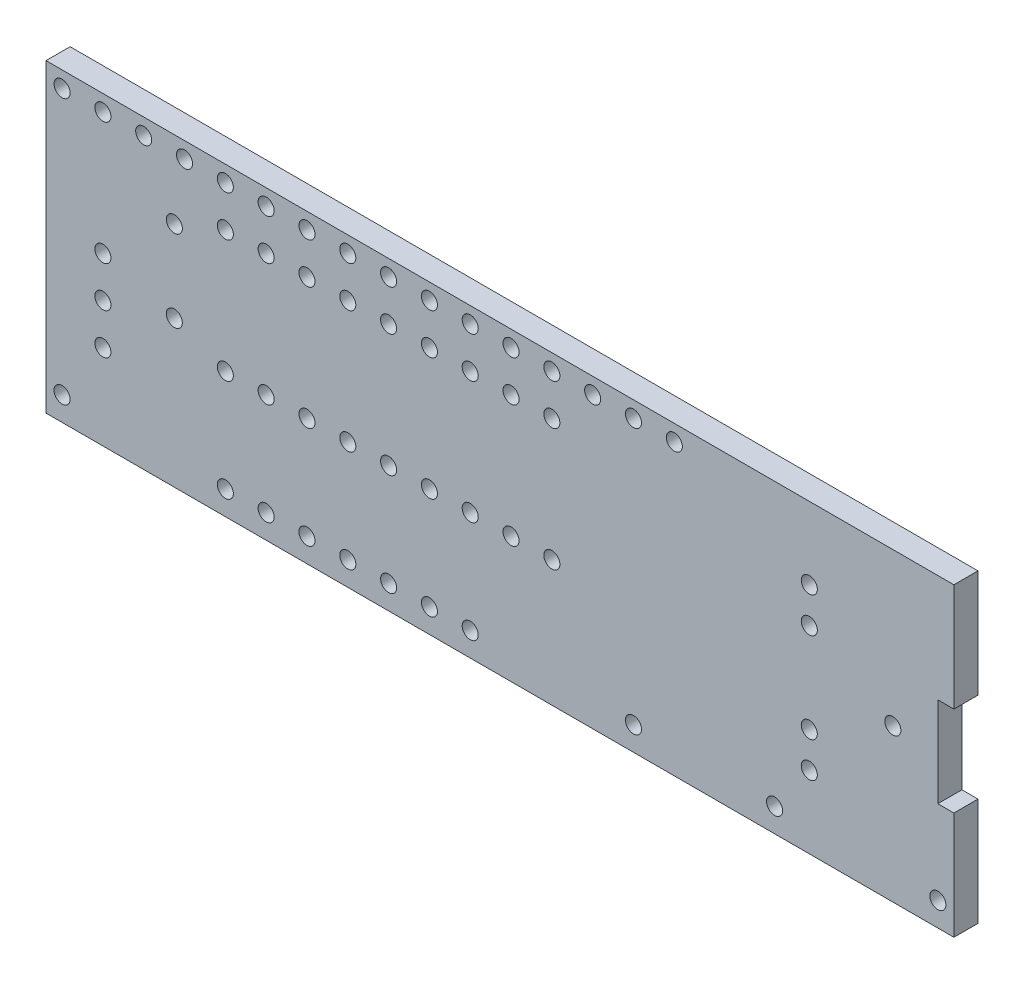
ISO-10303-21;
HEADER;
FILE_DESCRIPTION(('STEP AP214'),'2;1');
FILE_NAME('part.step','',(''),(''),'','','');
FILE_SCHEMA(('AUTOMOTIVE_DESIGN { 1 0 10303 214 1 1 1 1 }'));
ENDSEC;
DATA;
#1=APPLICATION_CONTEXT('core data for automotive mechanical design processes');
#2=APPLICATION_PROTOCOL_DEFINITION('international standard','automotive_design',2000,#1);
#3=PRODUCT_CONTEXT('',#1,'mechanical');
#4=PRODUCT('Part','Part','',(#3));
#5=PRODUCT_RELATED_PRODUCT_CATEGORY('part','',(#4));
#6=PRODUCT_DEFINITION_FORMATION('','',#4);
#7=PRODUCT_DEFINITION_CONTEXT('part definition',#1,'design');
#8=PRODUCT_DEFINITION('design','',#6,#7);
#9=PRODUCT_DEFINITION_SHAPE('','',#8);
#10=(LENGTH_UNIT() NAMED_UNIT(*) SI_UNIT(.MILLI.,.METRE.));
#11=(NAMED_UNIT(*) PLANE_ANGLE_UNIT() SI_UNIT($,.RADIAN.));
#12=(NAMED_UNIT(*) SI_UNIT($,.STERADIAN.) SOLID_ANGLE_UNIT());
#13=UNCERTAINTY_MEASURE_WITH_UNIT(LENGTH_MEASURE(1.E-05),#10,'distance_accuracy_value','');
#14=(GEOMETRIC_REPRESENTATION_CONTEXT(3) GLOBAL_UNCERTAINTY_ASSIGNED_CONTEXT((#13)) GLOBAL_UNIT_ASSIGNED_CONTEXT((#10,
#11,#12)) REPRESENTATION_CONTEXT('',''));
#15=CARTESIAN_POINT('',(0.,0.,0.));
#16=DIRECTION('',(0.,0.,1.));
#17=DIRECTION('',(1.,0.,0.));
#18=AXIS2_PLACEMENT_3D('',#15,#16,#17);
#19=CARTESIAN_POINT('',(0.,0.,1.5));
#20=DIRECTION('',(0.,0.,-1.));
#21=DIRECTION('',(-1.,0.,0.));
#22=AXIS2_PLACEMENT_3D('',#19,#20,#21);
#23=PLANE('',#22);
#24=CARTESIAN_POINT('',(7.985,14.19,1.5));
#25=DIRECTION('',(0.,0.,1.));
#26=DIRECTION('',(1.,0.,0.));
#27=AXIS2_PLACEMENT_3D('',#24,#25,#26);
#28=CIRCLE('',#27,0.500000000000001);
#29=CARTESIAN_POINT('',(8.485,14.19,1.5));
#30=VERTEX_POINT('',#29);
#31=EDGE_CURVE('E498',#30,#30,#28,.T.);
#32=ORIENTED_EDGE('',*,*,#31,.F.);
#33=EDGE_LOOP('',(#32));
#34=FACE_BOUND('',#33,.T.);
#35=CARTESIAN_POINT('',(47.5,4.5,1.5));
#36=DIRECTION('',(0.,0.,1.));
#37=DIRECTION('',(-1.,0.,0.));
#38=AXIS2_PLACEMENT_3D('',#35,#36,#37);
#39=CIRCLE('',#38,0.499999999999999);
#40=CARTESIAN_POINT('',(47.,4.5,1.5));
#41=VERTEX_POINT('',#40);
#42=EDGE_CURVE('E486',#41,#41,#39,.T.);
#43=ORIENTED_EDGE('',*,*,#42,.F.);
#44=EDGE_LOOP('',(#43));
#45=FACE_BOUND('',#44,.T.);
#46=CARTESIAN_POINT('',(47.5,14.5,1.5));
#47=DIRECTION('',(0.,0.,1.));
#48=DIRECTION('',(1.,0.,0.));
#49=AXIS2_PLACEMENT_3D('',#46,#47,#48);
#50=CIRCLE('',#49,0.499999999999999);
#51=CARTESIAN_POINT('',(48.,14.5,1.5));
#52=VERTEX_POINT('',#51);
#53=EDGE_CURVE('E474',#52,#52,#50,.T.);
#54=ORIENTED_EDGE('',*,*,#53,.F.);
#55=EDGE_LOOP('',(#54));
#56=FACE_BOUND('',#55,.T.);
#57=CARTESIAN_POINT('',(3.54000000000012,10.38,1.5));
#58=DIRECTION('',(0.,0.,1.));
#59=DIRECTION('',(1.,0.,0.));
#60=AXIS2_PLACEMENT_3D('',#57,#58,#59);
#61=CIRCLE('',#60,0.5);
#62=CARTESIAN_POINT('',(4.04000000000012,10.38,1.5));
#63=VERTEX_POINT('',#62);
#64=EDGE_CURVE('E462',#63,#63,#61,.T.);
#65=ORIENTED_EDGE('',*,*,#64,.F.);
#66=EDGE_LOOP('',(#65));
#67=FACE_BOUND('',#66,.T.);
#68=CARTESIAN_POINT('',(3.54000000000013,5.3,1.5));
#69=DIRECTION('',(0.,0.,1.));
#70=DIRECTION('',(1.,0.,0.));
#71=AXIS2_PLACEMENT_3D('',#68,#69,#70);
#72=CIRCLE('',#71,0.5);
#73=CARTESIAN_POINT('',(4.04000000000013,5.3,1.5));
#74=VERTEX_POINT('',#73);
#75=EDGE_CURVE('E450',#74,#74,#72,.T.);
#76=ORIENTED_EDGE('',*,*,#75,.F.);
#77=EDGE_LOOP('',(#76));
#78=FACE_BOUND('',#77,.T.);
#79=CARTESIAN_POINT('',(55.4999999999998,1.48999999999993,1.5));
#80=DIRECTION('',(0.,0.,1.));
#81=DIRECTION('',(-1.,0.,0.));
#82=AXIS2_PLACEMENT_3D('',#79,#80,#81);
#83=CIRCLE('',#82,0.499999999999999);
#84=CARTESIAN_POINT('',(54.9999999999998,1.48999999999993,1.5));
#85=VERTEX_POINT('',#84);
#86=EDGE_CURVE('E438',#85,#85,#83,.T.);
#87=ORIENTED_EDGE('',*,*,#86,.F.);
#88=EDGE_LOOP('',(#87));
#89=FACE_BOUND('',#88,.T.);
#90=CARTESIAN_POINT('',(36.5600000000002,1.49,1.5));
#91=DIRECTION('',(0.,0.,1.));
#92=DIRECTION('',(1.,0.,0.));
#93=AXIS2_PLACEMENT_3D('',#90,#91,#92);
#94=CIRCLE('',#93,0.499999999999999);
#95=CARTESIAN_POINT('',(37.0600000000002,1.49,1.5));
#96=VERTEX_POINT('',#95);
#97=EDGE_CURVE('E426',#96,#96,#94,.T.);
#98=ORIENTED_EDGE('',*,*,#97,.F.);
#99=EDGE_LOOP('',(#98));
#100=FACE_BOUND('',#99,.T.);
#101=CARTESIAN_POINT('',(23.8600000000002,1.49,1.5));
#102=DIRECTION('',(0.,0.,1.));
#103=DIRECTION('',(1.,0.,0.));
#104=AXIS2_PLACEMENT_3D('',#101,#102,#103);
#105=CIRCLE('',#104,0.499999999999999);
#106=CARTESIAN_POINT('',(24.3600000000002,1.49,1.5));
#107=VERTEX_POINT('',#106);
#108=EDGE_CURVE('E414',#107,#107,#105,.T.);
#109=ORIENTED_EDGE('',*,*,#108,.F.);
#110=EDGE_LOOP('',(#109));
#111=FACE_BOUND('',#110,.T.);
#112=CARTESIAN_POINT('',(18.7800000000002,1.49,1.5));
#113=DIRECTION('',(0.,0.,1.));
#114=DIRECTION('',(1.,0.,0.));
#115=AXIS2_PLACEMENT_3D('',#112,#113,#114);
#116=CIRCLE('',#115,0.499999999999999);
#117=CARTESIAN_POINT('',(19.2800000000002,1.49,1.5));
#118=VERTEX_POINT('',#117);
#119=EDGE_CURVE('E402',#118,#118,#116,.T.);
#120=ORIENTED_EDGE('',*,*,#119,.F.);
#121=EDGE_LOOP('',(#120));
#122=FACE_BOUND('',#121,.T.);
#123=CARTESIAN_POINT('',(13.7000000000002,1.49,1.5));
#124=DIRECTION('',(0.,0.,1.));
#125=DIRECTION('',(1.,0.,0.));
#126=AXIS2_PLACEMENT_3D('',#123,#124,#125);
#127=CIRCLE('',#126,0.499999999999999);
#128=CARTESIAN_POINT('',(14.2000000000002,1.49,1.5));
#129=VERTEX_POINT('',#128);
#130=EDGE_CURVE('E390',#129,#129,#127,.T.);
#131=ORIENTED_EDGE('',*,*,#130,.F.);
#132=EDGE_LOOP('',(#131));
#133=FACE_BOUND('',#132,.T.);
#134=CARTESIAN_POINT('',(31.4800000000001,7.84,1.5));
#135=DIRECTION('',(0.,0.,1.));
#136=DIRECTION('',(1.,0.,0.));
#137=AXIS2_PLACEMENT_3D('',#134,#135,#136);
#138=CIRCLE('',#137,0.499999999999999);
#139=CARTESIAN_POINT('',(31.9800000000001,7.84,1.5));
#140=VERTEX_POINT('',#139);
#141=EDGE_CURVE('E378',#140,#140,#138,.T.);
#142=ORIENTED_EDGE('',*,*,#141,.F.);
#143=EDGE_LOOP('',(#142));
#144=FACE_BOUND('',#143,.T.);
#145=CARTESIAN_POINT('',(26.4000000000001,7.84,1.5));
#146=DIRECTION('',(0.,0.,1.));
#147=DIRECTION('',(1.,0.,0.));
#148=AXIS2_PLACEMENT_3D('',#145,#146,#147);
#149=CIRCLE('',#148,0.499999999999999);
#150=CARTESIAN_POINT('',(26.9000000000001,7.84,1.5));
#151=VERTEX_POINT('',#150);
#152=EDGE_CURVE('E366',#151,#151,#149,.T.);
#153=ORIENTED_EDGE('',*,*,#152,.F.);
#154=EDGE_LOOP('',(#153));
#155=FACE_BOUND('',#154,.T.);
#156=CARTESIAN_POINT('',(21.3200000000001,7.84,1.5));
#157=DIRECTION('',(0.,0.,1.));
#158=DIRECTION('',(1.,0.,0.));
#159=AXIS2_PLACEMENT_3D('',#156,#157,#158);
#160=CIRCLE('',#159,0.499999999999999);
#161=CARTESIAN_POINT('',(21.8200000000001,7.84,1.5));
#162=VERTEX_POINT('',#161);
#163=EDGE_CURVE('E354',#162,#162,#160,.T.);
#164=ORIENTED_EDGE('',*,*,#163,.F.);
#165=EDGE_LOOP('',(#164));
#166=FACE_BOUND('',#165,.T.);
#167=CARTESIAN_POINT('',(16.2400000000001,7.84,1.5));
#168=DIRECTION('',(0.,0.,1.));
#169=DIRECTION('',(1.,0.,0.));
#170=AXIS2_PLACEMENT_3D('',#167,#168,#169);
#171=CIRCLE('',#170,0.499999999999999);
#172=CARTESIAN_POINT('',(16.7400000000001,7.84,1.5));
#173=VERTEX_POINT('',#172);
#174=EDGE_CURVE('E342',#173,#173,#171,.T.);
#175=ORIENTED_EDGE('',*,*,#174,.F.);
#176=EDGE_LOOP('',(#175));
#177=FACE_BOUND('',#176,.T.);
#178=CARTESIAN_POINT('',(11.1600000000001,7.84,1.5));
#179=DIRECTION('',(0.,0.,1.));
#180=DIRECTION('',(1.,0.,0.));
#181=AXIS2_PLACEMENT_3D('',#178,#179,#180);
#182=CIRCLE('',#181,0.499999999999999);
#183=CARTESIAN_POINT('',(11.6600000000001,7.84,1.5));
#184=VERTEX_POINT('',#183);
#185=EDGE_CURVE('E330',#184,#184,#182,.T.);
#186=ORIENTED_EDGE('',*,*,#185,.F.);
#187=EDGE_LOOP('',(#186));
#188=FACE_BOUND('',#187,.T.);
#189=CARTESIAN_POINT('',(28.94,15.46,1.5));
#190=DIRECTION('',(0.,0.,1.));
#191=DIRECTION('',(1.,0.,0.));
#192=AXIS2_PLACEMENT_3D('',#189,#190,#191);
#193=CIRCLE('',#192,0.499999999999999);
#194=CARTESIAN_POINT('',(29.44,15.46,1.5));
#195=VERTEX_POINT('',#194);
#196=EDGE_CURVE('E318',#195,#195,#193,.T.);
#197=ORIENTED_EDGE('',*,*,#196,.F.);
#198=EDGE_LOOP('',(#197));
#199=FACE_BOUND('',#198,.T.);
#200=CARTESIAN_POINT('',(23.86,15.46,1.5));
#201=DIRECTION('',(0.,0.,1.));
#202=DIRECTION('',(1.,0.,0.));
#203=AXIS2_PLACEMENT_3D('',#200,#201,#202);
#204=CIRCLE('',#203,0.499999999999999);
#205=CARTESIAN_POINT('',(24.36,15.46,1.5));
#206=VERTEX_POINT('',#205);
#207=EDGE_CURVE('E306',#206,#206,#204,.T.);
#208=ORIENTED_EDGE('',*,*,#207,.F.);
#209=EDGE_LOOP('',(#208));
#210=FACE_BOUND('',#209,.T.);
#211=CARTESIAN_POINT('',(18.78,15.46,1.5));
#212=DIRECTION('',(0.,0.,1.));
#213=DIRECTION('',(1.,0.,0.));
#214=AXIS2_PLACEMENT_3D('',#211,#212,#213);
#215=CIRCLE('',#214,0.499999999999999);
#216=CARTESIAN_POINT('',(19.28,15.46,1.5));
#217=VERTEX_POINT('',#216);
#218=EDGE_CURVE('E294',#217,#217,#215,.T.);
#219=ORIENTED_EDGE('',*,*,#218,.F.);
#220=EDGE_LOOP('',(#219));
#221=FACE_BOUND('',#220,.T.);
#222=CARTESIAN_POINT('',(13.7,15.46,1.5));
#223=DIRECTION('',(0.,0.,1.));
#224=DIRECTION('',(1.,0.,0.));
#225=AXIS2_PLACEMENT_3D('',#222,#223,#224);
#226=CIRCLE('',#225,0.499999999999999);
#227=CARTESIAN_POINT('',(14.2,15.46,1.5));
#228=VERTEX_POINT('',#227);
#229=EDGE_CURVE('E282',#228,#228,#226,.T.);
#230=ORIENTED_EDGE('',*,*,#229,.F.);
#231=EDGE_LOOP('',(#230));
#232=FACE_BOUND('',#231,.T.);
#233=CARTESIAN_POINT('',(39.1,18.,1.5));
#234=DIRECTION('',(0.,0.,1.));
#235=DIRECTION('',(1.,0.,0.));
#236=AXIS2_PLACEMENT_3D('',#233,#234,#235);
#237=CIRCLE('',#236,0.499999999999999);
#238=CARTESIAN_POINT('',(39.6,18.,1.5));
#239=VERTEX_POINT('',#238);
#240=EDGE_CURVE('E270',#239,#239,#237,.T.);
#241=ORIENTED_EDGE('',*,*,#240,.F.);
#242=EDGE_LOOP('',(#241));
#243=FACE_BOUND('',#242,.T.);
#244=CARTESIAN_POINT('',(34.02,18.,1.5));
#245=DIRECTION('',(0.,0.,1.));
#246=DIRECTION('',(1.,0.,0.));
#247=AXIS2_PLACEMENT_3D('',#244,#245,#246);
#248=CIRCLE('',#247,0.499999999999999);
#249=CARTESIAN_POINT('',(34.52,18.,1.5));
#250=VERTEX_POINT('',#249);
#251=EDGE_CURVE('E258',#250,#250,#248,.T.);
#252=ORIENTED_EDGE('',*,*,#251,.F.);
#253=EDGE_LOOP('',(#252));
#254=FACE_BOUND('',#253,.T.);
#255=CARTESIAN_POINT('',(28.94,18.,1.5));
#256=DIRECTION('',(0.,0.,1.));
#257=DIRECTION('',(1.,0.,0.));
#258=AXIS2_PLACEMENT_3D('',#255,#256,#257);
#259=CIRCLE('',#258,0.499999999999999);
#260=CARTESIAN_POINT('',(29.44,18.,1.5));
#261=VERTEX_POINT('',#260);
#262=EDGE_CURVE('E246',#261,#261,#259,.T.);
#263=ORIENTED_EDGE('',*,*,#262,.F.);
#264=EDGE_LOOP('',(#263));
#265=FACE_BOUND('',#264,.T.);
#266=CARTESIAN_POINT('',(23.86,18.,1.5));
#267=DIRECTION('',(0.,0.,1.));
#268=DIRECTION('',(1.,0.,0.));
#269=AXIS2_PLACEMENT_3D('',#266,#267,#268);
#270=CIRCLE('',#269,0.499999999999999);
#271=CARTESIAN_POINT('',(24.36,18.,1.5));
#272=VERTEX_POINT('',#271);
#273=EDGE_CURVE('E234',#272,#272,#270,.T.);
#274=ORIENTED_EDGE('',*,*,#273,.F.);
#275=EDGE_LOOP('',(#274));
#276=FACE_BOUND('',#275,.T.);
#277=CARTESIAN_POINT('',(18.78,18.,1.5));
#278=DIRECTION('',(0.,0.,1.));
#279=DIRECTION('',(1.,0.,0.));
#280=AXIS2_PLACEMENT_3D('',#277,#278,#279);
#281=CIRCLE('',#280,0.499999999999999);
#282=CARTESIAN_POINT('',(19.28,18.,1.5));
#283=VERTEX_POINT('',#282);
#284=EDGE_CURVE('E222',#283,#283,#281,.T.);
#285=ORIENTED_EDGE('',*,*,#284,.F.);
#286=EDGE_LOOP('',(#285));
#287=FACE_BOUND('',#286,.T.);
#288=CARTESIAN_POINT('',(13.7,18.,1.5));
#289=DIRECTION('',(0.,0.,1.));
#290=DIRECTION('',(1.,0.,0.));
#291=AXIS2_PLACEMENT_3D('',#288,#289,#290);
#292=CIRCLE('',#291,0.499999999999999);
#293=CARTESIAN_POINT('',(14.2,18.,1.5));
#294=VERTEX_POINT('',#293);
#295=EDGE_CURVE('E210',#294,#294,#292,.T.);
#296=ORIENTED_EDGE('',*,*,#295,.F.);
#297=EDGE_LOOP('',(#296));
#298=FACE_BOUND('',#297,.T.);
#299=CARTESIAN_POINT('',(8.62,18.,1.5));
#300=DIRECTION('',(0.,0.,1.));
#301=DIRECTION('',(1.,0.,0.));
#302=AXIS2_PLACEMENT_3D('',#299,#300,#301);
#303=CIRCLE('',#302,0.499999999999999);
#304=CARTESIAN_POINT('',(9.12,18.,1.5));
#305=VERTEX_POINT('',#304);
#306=EDGE_CURVE('E198',#305,#305,#303,.T.);
#307=ORIENTED_EDGE('',*,*,#306,.F.);
#308=EDGE_LOOP('',(#307));
#309=FACE_BOUND('',#308,.T.);
#310=CARTESIAN_POINT('',(3.54,18.,1.5));
#311=DIRECTION('',(0.,0.,1.));
#312=DIRECTION('',(1.,0.,0.));
#313=AXIS2_PLACEMENT_3D('',#310,#311,#312);
#314=CIRCLE('',#313,0.5);
#315=CARTESIAN_POINT('',(4.04,18.,1.5));
#316=VERTEX_POINT('',#315);
#317=EDGE_CURVE('E186',#316,#316,#314,.T.);
#318=ORIENTED_EDGE('',*,*,#317,.F.);
#319=EDGE_LOOP('',(#318));
#320=FACE_BOUND('',#319,.T.);
#321=DIRECTION('',(0.,-1.,0.));
#322=VECTOR('',#321,1.);
#323=CARTESIAN_POINT('',(0.,0.,1.5));
#324=LINE('',#323,#322);
#325=CARTESIAN_POINT('',(0.,19.,1.5));
#326=VERTEX_POINT('',#325);
#327=CARTESIAN_POINT('',(0.,0.,1.5));
#328=VERTEX_POINT('',#327);
#329=EDGE_CURVE('E149',#326,#328,#324,.T.);
#330=ORIENTED_EDGE('',*,*,#329,.T.);
#331=DIRECTION('',(1.,0.,0.));
#332=VECTOR('',#331,1.);
#333=CARTESIAN_POINT('',(0.,0.,1.5));
#334=LINE('',#333,#332);
#335=CARTESIAN_POINT('',(56.5,0.,1.5));
#336=VERTEX_POINT('',#335);
#337=EDGE_CURVE('E97',#328,#336,#334,.T.);
#338=ORIENTED_EDGE('',*,*,#337,.T.);
#339=DIRECTION('',(0.,1.,0.));
#340=VECTOR('',#339,1.);
#341=CARTESIAN_POINT('',(56.5,0.,1.5));
#342=LINE('',#341,#340);
#343=CARTESIAN_POINT('',(56.5,6.7,1.5));
#344=VERTEX_POINT('',#343);
#345=EDGE_CURVE('E164',#336,#344,#342,.T.);
#346=ORIENTED_EDGE('',*,*,#345,.T.);
#347=DIRECTION('',(-1.,0.,0.));
#348=VECTOR('',#347,1.);
#349=CARTESIAN_POINT('',(56.5,6.7,1.5));
#350=LINE('',#349,#348);
#351=CARTESIAN_POINT('',(55.5,6.7,1.5));
#352=VERTEX_POINT('',#351);
#353=EDGE_CURVE('E177',#344,#352,#350,.T.);
#354=ORIENTED_EDGE('',*,*,#353,.T.);
#355=DIRECTION('',(0.,1.,0.));
#356=VECTOR('',#355,1.);
#357=CARTESIAN_POINT('',(55.5,12.3,1.5));
#358=LINE('',#357,#356);
#359=CARTESIAN_POINT('',(55.5,12.3,1.5));
#360=VERTEX_POINT('',#359);
#361=EDGE_CURVE('E116',#352,#360,#358,.T.);
#362=ORIENTED_EDGE('',*,*,#361,.T.);
#363=DIRECTION('',(1.,0.,0.));
#364=VECTOR('',#363,1.);
#365=CARTESIAN_POINT('',(56.5,12.3,1.5));
#366=LINE('',#365,#364);
#367=CARTESIAN_POINT('',(56.5,12.3,1.5));
#368=VERTEX_POINT('',#367);
#369=EDGE_CURVE('E110',#360,#368,#366,.T.);
#370=ORIENTED_EDGE('',*,*,#369,.T.);
#371=DIRECTION('',(0.,1.,0.));
#372=VECTOR('',#371,1.);
#373=CARTESIAN_POINT('',(56.5,12.3,1.5));
#374=LINE('',#373,#372);
#375=CARTESIAN_POINT('',(56.5,19.,1.5));
#376=VERTEX_POINT('',#375);
#377=EDGE_CURVE('E114',#368,#376,#374,.T.);
#378=ORIENTED_EDGE('',*,*,#377,.T.);
#379=DIRECTION('',(-1.,0.,0.));
#380=VECTOR('',#379,1.);
#381=CARTESIAN_POINT('',(0.,19.,1.5));
#382=LINE('',#381,#380);
#383=EDGE_CURVE('E54',#376,#326,#382,.T.);
#384=ORIENTED_EDGE('',*,*,#383,.T.);
#385=EDGE_LOOP('',(#330,#338,#346,#354,#362,#370,#378,#384));
#386=FACE_BOUND('',#385,.T.);
#387=CARTESIAN_POINT('',(1.,18.,1.5));
#388=DIRECTION('',(0.,0.,1.));
#389=DIRECTION('',(1.,0.,0.));
#390=AXIS2_PLACEMENT_3D('',#387,#388,#389);
#391=CIRCLE('',#390,0.5);
#392=CARTESIAN_POINT('',(1.5,18.,1.5));
#393=VERTEX_POINT('',#392);
#394=EDGE_CURVE('E138',#393,#393,#391,.T.);
#395=ORIENTED_EDGE('',*,*,#394,.F.);
#396=EDGE_LOOP('',(#395));
#397=FACE_BOUND('',#396,.T.);
#398=CARTESIAN_POINT('',(6.08,18.,1.5));
#399=DIRECTION('',(0.,0.,1.));
#400=DIRECTION('',(1.,0.,0.));
#401=AXIS2_PLACEMENT_3D('',#398,#399,#400);
#402=CIRCLE('',#401,0.500000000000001);
#403=CARTESIAN_POINT('',(6.58,18.,1.5));
#404=VERTEX_POINT('',#403);
#405=EDGE_CURVE('E192',#404,#404,#402,.T.);
#406=ORIENTED_EDGE('',*,*,#405,.F.);
#407=EDGE_LOOP('',(#406));
#408=FACE_BOUND('',#407,.T.);
#409=CARTESIAN_POINT('',(11.16,18.,1.5));
#410=DIRECTION('',(0.,0.,1.));
#411=DIRECTION('',(1.,0.,0.));
#412=AXIS2_PLACEMENT_3D('',#409,#410,#411);
#413=CIRCLE('',#412,0.499999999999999);
#414=CARTESIAN_POINT('',(11.66,18.,1.5));
#415=VERTEX_POINT('',#414);
#416=EDGE_CURVE('E204',#415,#415,#413,.T.);
#417=ORIENTED_EDGE('',*,*,#416,.F.);
#418=EDGE_LOOP('',(#417));
#419=FACE_BOUND('',#418,.T.);
#420=CARTESIAN_POINT('',(16.24,18.,1.5));
#421=DIRECTION('',(0.,0.,1.));
#422=DIRECTION('',(1.,0.,0.));
#423=AXIS2_PLACEMENT_3D('',#420,#421,#422);
#424=CIRCLE('',#423,0.499999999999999);
#425=CARTESIAN_POINT('',(16.74,18.,1.5));
#426=VERTEX_POINT('',#425);
#427=EDGE_CURVE('E216',#426,#426,#424,.T.);
#428=ORIENTED_EDGE('',*,*,#427,.F.);
#429=EDGE_LOOP('',(#428));
#430=FACE_BOUND('',#429,.T.);
#431=CARTESIAN_POINT('',(21.32,18.,1.5));
#432=DIRECTION('',(0.,0.,1.));
#433=DIRECTION('',(1.,0.,0.));
#434=AXIS2_PLACEMENT_3D('',#431,#432,#433);
#435=CIRCLE('',#434,0.499999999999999);
#436=CARTESIAN_POINT('',(21.82,18.,1.5));
#437=VERTEX_POINT('',#436);
#438=EDGE_CURVE('E228',#437,#437,#435,.T.);
#439=ORIENTED_EDGE('',*,*,#438,.F.);
#440=EDGE_LOOP('',(#439));
#441=FACE_BOUND('',#440,.T.);
#442=CARTESIAN_POINT('',(26.4,18.,1.5));
#443=DIRECTION('',(0.,0.,1.));
#444=DIRECTION('',(1.,0.,0.));
#445=AXIS2_PLACEMENT_3D('',#442,#443,#444);
#446=CIRCLE('',#445,0.499999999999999);
#447=CARTESIAN_POINT('',(26.9,18.,1.5));
#448=VERTEX_POINT('',#447);
#449=EDGE_CURVE('E240',#448,#448,#446,.T.);
#450=ORIENTED_EDGE('',*,*,#449,.F.);
#451=EDGE_LOOP('',(#450));
#452=FACE_BOUND('',#451,.T.);
#453=CARTESIAN_POINT('',(31.48,18.,1.5));
#454=DIRECTION('',(0.,0.,1.));
#455=DIRECTION('',(1.,0.,0.));
#456=AXIS2_PLACEMENT_3D('',#453,#454,#455);
#457=CIRCLE('',#456,0.499999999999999);
#458=CARTESIAN_POINT('',(31.98,18.,1.5));
#459=VERTEX_POINT('',#458);
#460=EDGE_CURVE('E252',#459,#459,#457,.T.);
#461=ORIENTED_EDGE('',*,*,#460,.F.);
#462=EDGE_LOOP('',(#461));
#463=FACE_BOUND('',#462,.T.);
#464=CARTESIAN_POINT('',(36.56,18.,1.5));
#465=DIRECTION('',(0.,0.,1.));
#466=DIRECTION('',(1.,0.,0.));
#467=AXIS2_PLACEMENT_3D('',#464,#465,#466);
#468=CIRCLE('',#467,0.499999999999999);
#469=CARTESIAN_POINT('',(37.06,18.,1.5));
#470=VERTEX_POINT('',#469);
#471=EDGE_CURVE('E264',#470,#470,#468,.T.);
#472=ORIENTED_EDGE('',*,*,#471,.F.);
#473=EDGE_LOOP('',(#472));
#474=FACE_BOUND('',#473,.T.);
#475=CARTESIAN_POINT('',(11.16,15.46,1.5));
#476=DIRECTION('',(0.,0.,1.));
#477=DIRECTION('',(1.,0.,0.));
#478=AXIS2_PLACEMENT_3D('',#475,#476,#477);
#479=CIRCLE('',#478,0.499999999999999);
#480=CARTESIAN_POINT('',(11.66,15.46,1.5));
#481=VERTEX_POINT('',#480);
#482=EDGE_CURVE('E276',#481,#481,#479,.T.);
#483=ORIENTED_EDGE('',*,*,#482,.F.);
#484=EDGE_LOOP('',(#483));
#485=FACE_BOUND('',#484,.T.);
#486=CARTESIAN_POINT('',(16.24,15.46,1.5));
#487=DIRECTION('',(0.,0.,1.));
#488=DIRECTION('',(1.,0.,0.));
#489=AXIS2_PLACEMENT_3D('',#486,#487,#488);
#490=CIRCLE('',#489,0.499999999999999);
#491=CARTESIAN_POINT('',(16.74,15.46,1.5));
#492=VERTEX_POINT('',#491);
#493=EDGE_CURVE('E288',#492,#492,#490,.T.);
#494=ORIENTED_EDGE('',*,*,#493,.F.);
#495=EDGE_LOOP('',(#494));
#496=FACE_BOUND('',#495,.T.);
#497=CARTESIAN_POINT('',(21.32,15.46,1.5));
#498=DIRECTION('',(0.,0.,1.));
#499=DIRECTION('',(1.,0.,0.));
#500=AXIS2_PLACEMENT_3D('',#497,#498,#499);
#501=CIRCLE('',#500,0.499999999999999);
#502=CARTESIAN_POINT('',(21.82,15.46,1.5));
#503=VERTEX_POINT('',#502);
#504=EDGE_CURVE('E300',#503,#503,#501,.T.);
#505=ORIENTED_EDGE('',*,*,#504,.F.);
#506=EDGE_LOOP('',(#505));
#507=FACE_BOUND('',#506,.T.);
#508=CARTESIAN_POINT('',(26.4,15.46,1.5));
#509=DIRECTION('',(0.,0.,1.));
#510=DIRECTION('',(1.,0.,0.));
#511=AXIS2_PLACEMENT_3D('',#508,#509,#510);
#512=CIRCLE('',#511,0.499999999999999);
#513=CARTESIAN_POINT('',(26.9,15.46,1.5));
#514=VERTEX_POINT('',#513);
#515=EDGE_CURVE('E312',#514,#514,#512,.T.);
#516=ORIENTED_EDGE('',*,*,#515,.F.);
#517=EDGE_LOOP('',(#516));
#518=FACE_BOUND('',#517,.T.);
#519=CARTESIAN_POINT('',(31.48,15.46,1.5));
#520=DIRECTION('',(0.,0.,1.));
#521=DIRECTION('',(1.,0.,0.));
#522=AXIS2_PLACEMENT_3D('',#519,#520,#521);
#523=CIRCLE('',#522,0.499999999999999);
#524=CARTESIAN_POINT('',(31.98,15.46,1.5));
#525=VERTEX_POINT('',#524);
#526=EDGE_CURVE('E324',#525,#525,#523,.T.);
#527=ORIENTED_EDGE('',*,*,#526,.F.);
#528=EDGE_LOOP('',(#527));
#529=FACE_BOUND('',#528,.T.);
#530=CARTESIAN_POINT('',(13.7000000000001,7.84,1.5));
#531=DIRECTION('',(0.,0.,1.));
#532=DIRECTION('',(1.,0.,0.));
#533=AXIS2_PLACEMENT_3D('',#530,#531,#532);
#534=CIRCLE('',#533,0.499999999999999);
#535=CARTESIAN_POINT('',(14.2000000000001,7.84,1.5));
#536=VERTEX_POINT('',#535);
#537=EDGE_CURVE('E336',#536,#536,#534,.T.);
#538=ORIENTED_EDGE('',*,*,#537,.F.);
#539=EDGE_LOOP('',(#538));
#540=FACE_BOUND('',#539,.T.);
#541=CARTESIAN_POINT('',(18.7800000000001,7.84,1.5));
#542=DIRECTION('',(0.,0.,1.));
#543=DIRECTION('',(1.,0.,0.));
#544=AXIS2_PLACEMENT_3D('',#541,#542,#543);
#545=CIRCLE('',#544,0.499999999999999);
#546=CARTESIAN_POINT('',(19.2800000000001,7.84,1.5));
#547=VERTEX_POINT('',#546);
#548=EDGE_CURVE('E348',#547,#547,#545,.T.);
#549=ORIENTED_EDGE('',*,*,#548,.F.);
#550=EDGE_LOOP('',(#549));
#551=FACE_BOUND('',#550,.T.);
#552=CARTESIAN_POINT('',(23.8600000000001,7.84,1.5));
#553=DIRECTION('',(0.,0.,1.));
#554=DIRECTION('',(1.,0.,0.));
#555=AXIS2_PLACEMENT_3D('',#552,#553,#554);
#556=CIRCLE('',#555,0.499999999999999);
#557=CARTESIAN_POINT('',(24.3600000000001,7.84,1.5));
#558=VERTEX_POINT('',#557);
#559=EDGE_CURVE('E360',#558,#558,#556,.T.);
#560=ORIENTED_EDGE('',*,*,#559,.F.);
#561=EDGE_LOOP('',(#560));
#562=FACE_BOUND('',#561,.T.);
#563=CARTESIAN_POINT('',(28.9400000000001,7.84,1.5));
#564=DIRECTION('',(0.,0.,1.));
#565=DIRECTION('',(1.,0.,0.));
#566=AXIS2_PLACEMENT_3D('',#563,#564,#565);
#567=CIRCLE('',#566,0.499999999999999);
#568=CARTESIAN_POINT('',(29.4400000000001,7.84,1.5));
#569=VERTEX_POINT('',#568);
#570=EDGE_CURVE('E372',#569,#569,#567,.T.);
#571=ORIENTED_EDGE('',*,*,#570,.F.);
#572=EDGE_LOOP('',(#571));
#573=FACE_BOUND('',#572,.T.);
#574=CARTESIAN_POINT('',(11.1600000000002,1.49,1.5));
#575=DIRECTION('',(0.,0.,1.));
#576=DIRECTION('',(1.,0.,0.));
#577=AXIS2_PLACEMENT_3D('',#574,#575,#576);
#578=CIRCLE('',#577,0.499999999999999);
#579=CARTESIAN_POINT('',(11.6600000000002,1.49,1.5));
#580=VERTEX_POINT('',#579);
#581=EDGE_CURVE('E384',#580,#580,#578,.T.);
#582=ORIENTED_EDGE('',*,*,#581,.F.);
#583=EDGE_LOOP('',(#582));
#584=FACE_BOUND('',#583,.T.);
#585=CARTESIAN_POINT('',(16.2400000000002,1.49,1.5));
#586=DIRECTION('',(0.,0.,1.));
#587=DIRECTION('',(1.,0.,0.));
#588=AXIS2_PLACEMENT_3D('',#585,#586,#587);
#589=CIRCLE('',#588,0.499999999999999);
#590=CARTESIAN_POINT('',(16.7400000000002,1.49,1.5));
#591=VERTEX_POINT('',#590);
#592=EDGE_CURVE('E396',#591,#591,#589,.T.);
#593=ORIENTED_EDGE('',*,*,#592,.F.);
#594=EDGE_LOOP('',(#593));
#595=FACE_BOUND('',#594,.T.);
#596=CARTESIAN_POINT('',(21.3200000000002,1.49,1.5));
#597=DIRECTION('',(0.,0.,1.));
#598=DIRECTION('',(1.,0.,0.));
#599=AXIS2_PLACEMENT_3D('',#596,#597,#598);
#600=CIRCLE('',#599,0.499999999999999);
#601=CARTESIAN_POINT('',(21.8200000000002,1.49,1.5));
#602=VERTEX_POINT('',#601);
#603=EDGE_CURVE('E408',#602,#602,#600,.T.);
#604=ORIENTED_EDGE('',*,*,#603,.F.);
#605=EDGE_LOOP('',(#604));
#606=FACE_BOUND('',#605,.T.);
#607=CARTESIAN_POINT('',(26.4000000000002,1.49,1.5));
#608=DIRECTION('',(0.,0.,1.));
#609=DIRECTION('',(1.,0.,0.));
#610=AXIS2_PLACEMENT_3D('',#607,#608,#609);
#611=CIRCLE('',#610,0.499999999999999);
#612=CARTESIAN_POINT('',(26.9000000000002,1.49,1.5));
#613=VERTEX_POINT('',#612);
#614=EDGE_CURVE('E420',#613,#613,#611,.T.);
#615=ORIENTED_EDGE('',*,*,#614,.F.);
#616=EDGE_LOOP('',(#615));
#617=FACE_BOUND('',#616,.T.);
#618=CARTESIAN_POINT('',(1.00000000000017,1.48999999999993,1.5));
#619=DIRECTION('',(0.,0.,1.));
#620=DIRECTION('',(1.,0.,0.));
#621=AXIS2_PLACEMENT_3D('',#618,#619,#620);
#622=CIRCLE('',#621,0.499999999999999);
#623=CARTESIAN_POINT('',(1.50000000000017,1.48999999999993,1.5));
#624=VERTEX_POINT('',#623);
#625=EDGE_CURVE('E432',#624,#624,#622,.T.);
#626=ORIENTED_EDGE('',*,*,#625,.F.);
#627=EDGE_LOOP('',(#626));
#628=FACE_BOUND('',#627,.T.);
#629=CARTESIAN_POINT('',(45.3399999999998,1.48999999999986,1.5));
#630=DIRECTION('',(0.,0.,1.));
#631=DIRECTION('',(-1.,0.,0.));
#632=AXIS2_PLACEMENT_3D('',#629,#630,#631);
#633=CIRCLE('',#632,0.499999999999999);
#634=CARTESIAN_POINT('',(44.8399999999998,1.48999999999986,1.5));
#635=VERTEX_POINT('',#634);
#636=EDGE_CURVE('E444',#635,#635,#633,.T.);
#637=ORIENTED_EDGE('',*,*,#636,.F.);
#638=EDGE_LOOP('',(#637));
#639=FACE_BOUND('',#638,.T.);
#640=CARTESIAN_POINT('',(3.54000000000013,7.84,1.5));
#641=DIRECTION('',(0.,0.,1.));
#642=DIRECTION('',(1.,0.,0.));
#643=AXIS2_PLACEMENT_3D('',#640,#641,#642);
#644=CIRCLE('',#643,0.5);
#645=CARTESIAN_POINT('',(4.04000000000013,7.84,1.5));
#646=VERTEX_POINT('',#645);
#647=EDGE_CURVE('E456',#646,#646,#644,.T.);
#648=ORIENTED_EDGE('',*,*,#647,.F.);
#649=EDGE_LOOP('',(#648));
#650=FACE_BOUND('',#649,.T.);
#651=CARTESIAN_POINT('',(52.7,9.5,1.5));
#652=DIRECTION('',(0.,0.,1.));
#653=DIRECTION('',(1.,0.,0.));
#654=AXIS2_PLACEMENT_3D('',#651,#652,#653);
#655=CIRCLE('',#654,0.499999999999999);
#656=CARTESIAN_POINT('',(53.2,9.5,1.5));
#657=VERTEX_POINT('',#656);
#658=EDGE_CURVE('E468',#657,#657,#655,.T.);
#659=ORIENTED_EDGE('',*,*,#658,.F.);
#660=EDGE_LOOP('',(#659));
#661=FACE_BOUND('',#660,.T.);
#662=CARTESIAN_POINT('',(47.5,12.3,1.5));
#663=DIRECTION('',(0.,0.,1.));
#664=DIRECTION('',(1.,0.,0.));
#665=AXIS2_PLACEMENT_3D('',#662,#663,#664);
#666=CIRCLE('',#665,0.499999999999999);
#667=CARTESIAN_POINT('',(48.,12.3,1.5));
#668=VERTEX_POINT('',#667);
#669=EDGE_CURVE('E480',#668,#668,#666,.T.);
#670=ORIENTED_EDGE('',*,*,#669,.F.);
#671=EDGE_LOOP('',(#670));
#672=FACE_BOUND('',#671,.T.);
#673=CARTESIAN_POINT('',(47.5,6.7,1.5));
#674=DIRECTION('',(0.,0.,1.));
#675=DIRECTION('',(-1.,0.,0.));
#676=AXIS2_PLACEMENT_3D('',#673,#674,#675);
#677=CIRCLE('',#676,0.499999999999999);
#678=CARTESIAN_POINT('',(47.,6.7,1.5));
#679=VERTEX_POINT('',#678);
#680=EDGE_CURVE('E492',#679,#679,#677,.T.);
#681=ORIENTED_EDGE('',*,*,#680,.F.);
#682=EDGE_LOOP('',(#681));
#683=FACE_BOUND('',#682,.T.);
#684=CARTESIAN_POINT('',(7.98500000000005,9.11,1.5));
#685=DIRECTION('',(0.,0.,1.));
#686=DIRECTION('',(1.,0.,0.));
#687=AXIS2_PLACEMENT_3D('',#684,#685,#686);
#688=CIRCLE('',#687,0.500000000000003);
#689=CARTESIAN_POINT('',(8.48500000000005,9.11,1.5));
#690=VERTEX_POINT('',#689);
#691=EDGE_CURVE('E504',#690,#690,#688,.T.);
#692=ORIENTED_EDGE('',*,*,#691,.F.);
#693=EDGE_LOOP('',(#692));
#694=FACE_BOUND('',#693,.T.);
#695=ADVANCED_FACE('F37',(#34,#45,#56,#67,#78,#89,#100,#111,#122,#133,#144,#155,#166,#177,#188,
#199,#210,#221,#232,#243,#254,#265,#276,#287,#298,#309,#320,#386,#397,#408,#419,#430,#441,#452,
#463,#474,#485,#496,#507,#518,#529,#540,#551,#562,#573,#584,#595,#606,#617,#628,#639,#650,#661,
#672,#683,#694),#23,.F.);
#696=CARTESIAN_POINT('',(0.,0.,0.));
#697=DIRECTION('',(0.,0.,-1.));
#698=DIRECTION('',(-1.,0.,0.));
#699=AXIS2_PLACEMENT_3D('',#696,#697,#698);
#700=PLANE('',#699);
#701=CARTESIAN_POINT('',(7.985,14.19,0.));
#702=DIRECTION('',(0.,0.,1.));
#703=DIRECTION('',(1.,0.,0.));
#704=AXIS2_PLACEMENT_3D('',#701,#702,#703);
#705=CIRCLE('',#704,0.500000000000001);
#706=CARTESIAN_POINT('',(8.485,14.19,0.));
#707=VERTEX_POINT('',#706);
#708=EDGE_CURVE('E501',#707,#707,#705,.T.);
#709=ORIENTED_EDGE('',*,*,#708,.T.);
#710=EDGE_LOOP('',(#709));
#711=FACE_BOUND('',#710,.T.);
#712=CARTESIAN_POINT('',(47.5,4.5,0.));
#713=DIRECTION('',(0.,0.,1.));
#714=DIRECTION('',(-1.,0.,0.));
#715=AXIS2_PLACEMENT_3D('',#712,#713,#714);
#716=CIRCLE('',#715,0.499999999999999);
#717=CARTESIAN_POINT('',(47.,4.5,0.));
#718=VERTEX_POINT('',#717);
#719=EDGE_CURVE('E489',#718,#718,#716,.T.);
#720=ORIENTED_EDGE('',*,*,#719,.T.);
#721=EDGE_LOOP('',(#720));
#722=FACE_BOUND('',#721,.T.);
#723=CARTESIAN_POINT('',(47.5,14.5,0.));
#724=DIRECTION('',(0.,0.,1.));
#725=DIRECTION('',(1.,0.,0.));
#726=AXIS2_PLACEMENT_3D('',#723,#724,#725);
#727=CIRCLE('',#726,0.499999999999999);
#728=CARTESIAN_POINT('',(48.,14.5,0.));
#729=VERTEX_POINT('',#728);
#730=EDGE_CURVE('E477',#729,#729,#727,.T.);
#731=ORIENTED_EDGE('',*,*,#730,.T.);
#732=EDGE_LOOP('',(#731));
#733=FACE_BOUND('',#732,.T.);
#734=CARTESIAN_POINT('',(3.54000000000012,10.38,0.));
#735=DIRECTION('',(0.,0.,1.));
#736=DIRECTION('',(1.,0.,0.));
#737=AXIS2_PLACEMENT_3D('',#734,#735,#736);
#738=CIRCLE('',#737,0.5);
#739=CARTESIAN_POINT('',(4.04000000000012,10.38,0.));
#740=VERTEX_POINT('',#739);
#741=EDGE_CURVE('E465',#740,#740,#738,.T.);
#742=ORIENTED_EDGE('',*,*,#741,.T.);
#743=EDGE_LOOP('',(#742));
#744=FACE_BOUND('',#743,.T.);
#745=CARTESIAN_POINT('',(3.54000000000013,5.3,0.));
#746=DIRECTION('',(0.,0.,1.));
#747=DIRECTION('',(1.,0.,0.));
#748=AXIS2_PLACEMENT_3D('',#745,#746,#747);
#749=CIRCLE('',#748,0.5);
#750=CARTESIAN_POINT('',(4.04000000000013,5.3,0.));
#751=VERTEX_POINT('',#750);
#752=EDGE_CURVE('E453',#751,#751,#749,.T.);
#753=ORIENTED_EDGE('',*,*,#752,.T.);
#754=EDGE_LOOP('',(#753));
#755=FACE_BOUND('',#754,.T.);
#756=CARTESIAN_POINT('',(55.4999999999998,1.48999999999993,0.));
#757=DIRECTION('',(0.,0.,1.));
#758=DIRECTION('',(-1.,0.,0.));
#759=AXIS2_PLACEMENT_3D('',#756,#757,#758);
#760=CIRCLE('',#759,0.499999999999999);
#761=CARTESIAN_POINT('',(54.9999999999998,1.48999999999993,0.));
#762=VERTEX_POINT('',#761);
#763=EDGE_CURVE('E441',#762,#762,#760,.T.);
#764=ORIENTED_EDGE('',*,*,#763,.T.);
#765=EDGE_LOOP('',(#764));
#766=FACE_BOUND('',#765,.T.);
#767=CARTESIAN_POINT('',(36.5600000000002,1.49,0.));
#768=DIRECTION('',(0.,0.,1.));
#769=DIRECTION('',(1.,0.,0.));
#770=AXIS2_PLACEMENT_3D('',#767,#768,#769);
#771=CIRCLE('',#770,0.499999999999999);
#772=CARTESIAN_POINT('',(37.0600000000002,1.49,0.));
#773=VERTEX_POINT('',#772);
#774=EDGE_CURVE('E429',#773,#773,#771,.T.);
#775=ORIENTED_EDGE('',*,*,#774,.T.);
#776=EDGE_LOOP('',(#775));
#777=FACE_BOUND('',#776,.T.);
#778=CARTESIAN_POINT('',(23.8600000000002,1.49,0.));
#779=DIRECTION('',(0.,0.,1.));
#780=DIRECTION('',(1.,0.,0.));
#781=AXIS2_PLACEMENT_3D('',#778,#779,#780);
#782=CIRCLE('',#781,0.499999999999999);
#783=CARTESIAN_POINT('',(24.3600000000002,1.49,0.));
#784=VERTEX_POINT('',#783);
#785=EDGE_CURVE('E417',#784,#784,#782,.T.);
#786=ORIENTED_EDGE('',*,*,#785,.T.);
#787=EDGE_LOOP('',(#786));
#788=FACE_BOUND('',#787,.T.);
#789=CARTESIAN_POINT('',(18.7800000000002,1.49,0.));
#790=DIRECTION('',(0.,0.,1.));
#791=DIRECTION('',(1.,0.,0.));
#792=AXIS2_PLACEMENT_3D('',#789,#790,#791);
#793=CIRCLE('',#792,0.499999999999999);
#794=CARTESIAN_POINT('',(19.2800000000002,1.49,0.));
#795=VERTEX_POINT('',#794);
#796=EDGE_CURVE('E405',#795,#795,#793,.T.);
#797=ORIENTED_EDGE('',*,*,#796,.T.);
#798=EDGE_LOOP('',(#797));
#799=FACE_BOUND('',#798,.T.);
#800=CARTESIAN_POINT('',(13.7000000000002,1.49,0.));
#801=DIRECTION('',(0.,0.,1.));
#802=DIRECTION('',(1.,0.,0.));
#803=AXIS2_PLACEMENT_3D('',#800,#801,#802);
#804=CIRCLE('',#803,0.499999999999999);
#805=CARTESIAN_POINT('',(14.2000000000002,1.49,0.));
#806=VERTEX_POINT('',#805);
#807=EDGE_CURVE('E393',#806,#806,#804,.T.);
#808=ORIENTED_EDGE('',*,*,#807,.T.);
#809=EDGE_LOOP('',(#808));
#810=FACE_BOUND('',#809,.T.);
#811=CARTESIAN_POINT('',(31.4800000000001,7.84,0.));
#812=DIRECTION('',(0.,0.,1.));
#813=DIRECTION('',(1.,0.,0.));
#814=AXIS2_PLACEMENT_3D('',#811,#812,#813);
#815=CIRCLE('',#814,0.499999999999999);
#816=CARTESIAN_POINT('',(31.9800000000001,7.84,0.));
#817=VERTEX_POINT('',#816);
#818=EDGE_CURVE('E381',#817,#817,#815,.T.);
#819=ORIENTED_EDGE('',*,*,#818,.T.);
#820=EDGE_LOOP('',(#819));
#821=FACE_BOUND('',#820,.T.);
#822=CARTESIAN_POINT('',(26.4000000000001,7.84,0.));
#823=DIRECTION('',(0.,0.,1.));
#824=DIRECTION('',(1.,0.,0.));
#825=AXIS2_PLACEMENT_3D('',#822,#823,#824);
#826=CIRCLE('',#825,0.499999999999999);
#827=CARTESIAN_POINT('',(26.9000000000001,7.84,0.));
#828=VERTEX_POINT('',#827);
#829=EDGE_CURVE('E369',#828,#828,#826,.T.);
#830=ORIENTED_EDGE('',*,*,#829,.T.);
#831=EDGE_LOOP('',(#830));
#832=FACE_BOUND('',#831,.T.);
#833=CARTESIAN_POINT('',(21.3200000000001,7.84,0.));
#834=DIRECTION('',(0.,0.,1.));
#835=DIRECTION('',(1.,0.,0.));
#836=AXIS2_PLACEMENT_3D('',#833,#834,#835);
#837=CIRCLE('',#836,0.499999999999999);
#838=CARTESIAN_POINT('',(21.8200000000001,7.84,0.));
#839=VERTEX_POINT('',#838);
#840=EDGE_CURVE('E357',#839,#839,#837,.T.);
#841=ORIENTED_EDGE('',*,*,#840,.T.);
#842=EDGE_LOOP('',(#841));
#843=FACE_BOUND('',#842,.T.);
#844=CARTESIAN_POINT('',(16.2400000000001,7.84,0.));
#845=DIRECTION('',(0.,0.,1.));
#846=DIRECTION('',(1.,0.,0.));
#847=AXIS2_PLACEMENT_3D('',#844,#845,#846);
#848=CIRCLE('',#847,0.499999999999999);
#849=CARTESIAN_POINT('',(16.7400000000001,7.84,0.));
#850=VERTEX_POINT('',#849);
#851=EDGE_CURVE('E345',#850,#850,#848,.T.);
#852=ORIENTED_EDGE('',*,*,#851,.T.);
#853=EDGE_LOOP('',(#852));
#854=FACE_BOUND('',#853,.T.);
#855=CARTESIAN_POINT('',(11.1600000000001,7.84,0.));
#856=DIRECTION('',(0.,0.,1.));
#857=DIRECTION('',(1.,0.,0.));
#858=AXIS2_PLACEMENT_3D('',#855,#856,#857);
#859=CIRCLE('',#858,0.499999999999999);
#860=CARTESIAN_POINT('',(11.6600000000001,7.84,0.));
#861=VERTEX_POINT('',#860);
#862=EDGE_CURVE('E333',#861,#861,#859,.T.);
#863=ORIENTED_EDGE('',*,*,#862,.T.);
#864=EDGE_LOOP('',(#863));
#865=FACE_BOUND('',#864,.T.);
#866=CARTESIAN_POINT('',(28.94,15.46,0.));
#867=DIRECTION('',(0.,0.,1.));
#868=DIRECTION('',(1.,0.,0.));
#869=AXIS2_PLACEMENT_3D('',#866,#867,#868);
#870=CIRCLE('',#869,0.499999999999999);
#871=CARTESIAN_POINT('',(29.44,15.46,0.));
#872=VERTEX_POINT('',#871);
#873=EDGE_CURVE('E321',#872,#872,#870,.T.);
#874=ORIENTED_EDGE('',*,*,#873,.T.);
#875=EDGE_LOOP('',(#874));
#876=FACE_BOUND('',#875,.T.);
#877=CARTESIAN_POINT('',(23.86,15.46,0.));
#878=DIRECTION('',(0.,0.,1.));
#879=DIRECTION('',(1.,0.,0.));
#880=AXIS2_PLACEMENT_3D('',#877,#878,#879);
#881=CIRCLE('',#880,0.499999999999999);
#882=CARTESIAN_POINT('',(24.36,15.46,0.));
#883=VERTEX_POINT('',#882);
#884=EDGE_CURVE('E309',#883,#883,#881,.T.);
#885=ORIENTED_EDGE('',*,*,#884,.T.);
#886=EDGE_LOOP('',(#885));
#887=FACE_BOUND('',#886,.T.);
#888=CARTESIAN_POINT('',(18.78,15.46,0.));
#889=DIRECTION('',(0.,0.,1.));
#890=DIRECTION('',(1.,0.,0.));
#891=AXIS2_PLACEMENT_3D('',#888,#889,#890);
#892=CIRCLE('',#891,0.499999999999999);
#893=CARTESIAN_POINT('',(19.28,15.46,0.));
#894=VERTEX_POINT('',#893);
#895=EDGE_CURVE('E297',#894,#894,#892,.T.);
#896=ORIENTED_EDGE('',*,*,#895,.T.);
#897=EDGE_LOOP('',(#896));
#898=FACE_BOUND('',#897,.T.);
#899=CARTESIAN_POINT('',(13.7,15.46,0.));
#900=DIRECTION('',(0.,0.,1.));
#901=DIRECTION('',(1.,0.,0.));
#902=AXIS2_PLACEMENT_3D('',#899,#900,#901);
#903=CIRCLE('',#902,0.499999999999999);
#904=CARTESIAN_POINT('',(14.2,15.46,0.));
#905=VERTEX_POINT('',#904);
#906=EDGE_CURVE('E285',#905,#905,#903,.T.);
#907=ORIENTED_EDGE('',*,*,#906,.T.);
#908=EDGE_LOOP('',(#907));
#909=FACE_BOUND('',#908,.T.);
#910=CARTESIAN_POINT('',(39.1,18.,0.));
#911=DIRECTION('',(0.,0.,1.));
#912=DIRECTION('',(1.,0.,0.));
#913=AXIS2_PLACEMENT_3D('',#910,#911,#912);
#914=CIRCLE('',#913,0.499999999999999);
#915=CARTESIAN_POINT('',(39.6,18.,0.));
#916=VERTEX_POINT('',#915);
#917=EDGE_CURVE('E273',#916,#916,#914,.T.);
#918=ORIENTED_EDGE('',*,*,#917,.T.);
#919=EDGE_LOOP('',(#918));
#920=FACE_BOUND('',#919,.T.);
#921=CARTESIAN_POINT('',(34.02,18.,0.));
#922=DIRECTION('',(0.,0.,1.));
#923=DIRECTION('',(1.,0.,0.));
#924=AXIS2_PLACEMENT_3D('',#921,#922,#923);
#925=CIRCLE('',#924,0.499999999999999);
#926=CARTESIAN_POINT('',(34.52,18.,0.));
#927=VERTEX_POINT('',#926);
#928=EDGE_CURVE('E261',#927,#927,#925,.T.);
#929=ORIENTED_EDGE('',*,*,#928,.T.);
#930=EDGE_LOOP('',(#929));
#931=FACE_BOUND('',#930,.T.);
#932=CARTESIAN_POINT('',(28.94,18.,0.));
#933=DIRECTION('',(0.,0.,1.));
#934=DIRECTION('',(1.,0.,0.));
#935=AXIS2_PLACEMENT_3D('',#932,#933,#934);
#936=CIRCLE('',#935,0.499999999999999);
#937=CARTESIAN_POINT('',(29.44,18.,0.));
#938=VERTEX_POINT('',#937);
#939=EDGE_CURVE('E249',#938,#938,#936,.T.);
#940=ORIENTED_EDGE('',*,*,#939,.T.);
#941=EDGE_LOOP('',(#940));
#942=FACE_BOUND('',#941,.T.);
#943=CARTESIAN_POINT('',(23.86,18.,0.));
#944=DIRECTION('',(0.,0.,1.));
#945=DIRECTION('',(1.,0.,0.));
#946=AXIS2_PLACEMENT_3D('',#943,#944,#945);
#947=CIRCLE('',#946,0.499999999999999);
#948=CARTESIAN_POINT('',(24.36,18.,0.));
#949=VERTEX_POINT('',#948);
#950=EDGE_CURVE('E237',#949,#949,#947,.T.);
#951=ORIENTED_EDGE('',*,*,#950,.T.);
#952=EDGE_LOOP('',(#951));
#953=FACE_BOUND('',#952,.T.);
#954=CARTESIAN_POINT('',(18.78,18.,0.));
#955=DIRECTION('',(0.,0.,1.));
#956=DIRECTION('',(1.,0.,0.));
#957=AXIS2_PLACEMENT_3D('',#954,#955,#956);
#958=CIRCLE('',#957,0.499999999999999);
#959=CARTESIAN_POINT('',(19.28,18.,0.));
#960=VERTEX_POINT('',#959);
#961=EDGE_CURVE('E225',#960,#960,#958,.T.);
#962=ORIENTED_EDGE('',*,*,#961,.T.);
#963=EDGE_LOOP('',(#962));
#964=FACE_BOUND('',#963,.T.);
#965=CARTESIAN_POINT('',(13.7,18.,0.));
#966=DIRECTION('',(0.,0.,1.));
#967=DIRECTION('',(1.,0.,0.));
#968=AXIS2_PLACEMENT_3D('',#965,#966,#967);
#969=CIRCLE('',#968,0.499999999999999);
#970=CARTESIAN_POINT('',(14.2,18.,0.));
#971=VERTEX_POINT('',#970);
#972=EDGE_CURVE('E213',#971,#971,#969,.T.);
#973=ORIENTED_EDGE('',*,*,#972,.T.);
#974=EDGE_LOOP('',(#973));
#975=FACE_BOUND('',#974,.T.);
#976=CARTESIAN_POINT('',(8.62,18.,0.));
#977=DIRECTION('',(0.,0.,1.));
#978=DIRECTION('',(1.,0.,0.));
#979=AXIS2_PLACEMENT_3D('',#976,#977,#978);
#980=CIRCLE('',#979,0.499999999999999);
#981=CARTESIAN_POINT('',(9.12,18.,0.));
#982=VERTEX_POINT('',#981);
#983=EDGE_CURVE('E201',#982,#982,#980,.T.);
#984=ORIENTED_EDGE('',*,*,#983,.T.);
#985=EDGE_LOOP('',(#984));
#986=FACE_BOUND('',#985,.T.);
#987=CARTESIAN_POINT('',(3.54,18.,0.));
#988=DIRECTION('',(0.,0.,1.));
#989=DIRECTION('',(1.,0.,0.));
#990=AXIS2_PLACEMENT_3D('',#987,#988,#989);
#991=CIRCLE('',#990,0.5);
#992=CARTESIAN_POINT('',(4.04,18.,0.));
#993=VERTEX_POINT('',#992);
#994=EDGE_CURVE('E189',#993,#993,#991,.T.);
#995=ORIENTED_EDGE('',*,*,#994,.T.);
#996=EDGE_LOOP('',(#995));
#997=FACE_BOUND('',#996,.T.);
#998=DIRECTION('',(0.,-1.,0.));
#999=VECTOR('',#998,1.);
#1000=CARTESIAN_POINT('',(0.,0.,0.));
#1001=LINE('',#1000,#999);
#1002=CARTESIAN_POINT('',(0.,19.,0.));
#1003=VERTEX_POINT('',#1002);
#1004=CARTESIAN_POINT('',(0.,0.,0.));
#1005=VERTEX_POINT('',#1004);
#1006=EDGE_CURVE('E134',#1003,#1005,#1001,.T.);
#1007=ORIENTED_EDGE('',*,*,#1006,.F.);
#1008=DIRECTION('',(-1.,0.,0.));
#1009=VECTOR('',#1008,1.);
#1010=CARTESIAN_POINT('',(0.,19.,0.));
#1011=LINE('',#1010,#1009);
#1012=CARTESIAN_POINT('',(56.5,19.,0.));
#1013=VERTEX_POINT('',#1012);
#1014=EDGE_CURVE('E89',#1013,#1003,#1011,.T.);
#1015=ORIENTED_EDGE('',*,*,#1014,.F.);
#1016=DIRECTION('',(0.,1.,0.));
#1017=VECTOR('',#1016,1.);
#1018=CARTESIAN_POINT('',(56.5,12.3,0.));
#1019=LINE('',#1018,#1017);
#1020=CARTESIAN_POINT('',(56.5,12.3,0.));
#1021=VERTEX_POINT('',#1020);
#1022=EDGE_CURVE('E83',#1021,#1013,#1019,.T.);
#1023=ORIENTED_EDGE('',*,*,#1022,.F.);
#1024=DIRECTION('',(1.,0.,0.));
#1025=VECTOR('',#1024,1.);
#1026=CARTESIAN_POINT('',(56.5,12.3,0.));
#1027=LINE('',#1026,#1025);
#1028=CARTESIAN_POINT('',(55.5,12.3,0.));
#1029=VERTEX_POINT('',#1028);
#1030=EDGE_CURVE('E124',#1029,#1021,#1027,.T.);
#1031=ORIENTED_EDGE('',*,*,#1030,.F.);
#1032=DIRECTION('',(0.,1.,0.));
#1033=VECTOR('',#1032,1.);
#1034=CARTESIAN_POINT('',(55.5,12.3,0.));
#1035=LINE('',#1034,#1033);
#1036=CARTESIAN_POINT('',(55.5,6.7,0.));
#1037=VERTEX_POINT('',#1036);
#1038=EDGE_CURVE('E144',#1037,#1029,#1035,.T.);
#1039=ORIENTED_EDGE('',*,*,#1038,.F.);
#1040=DIRECTION('',(-1.,0.,0.));
#1041=VECTOR('',#1040,1.);
#1042=CARTESIAN_POINT('',(56.5,6.7,0.));
#1043=LINE('',#1042,#1041);
#1044=CARTESIAN_POINT('',(56.5,6.7,0.));
#1045=VERTEX_POINT('',#1044);
#1046=EDGE_CURVE('E142',#1045,#1037,#1043,.T.);
#1047=ORIENTED_EDGE('',*,*,#1046,.F.);
#1048=DIRECTION('',(0.,1.,0.));
#1049=VECTOR('',#1048,1.);
#1050=CARTESIAN_POINT('',(56.5,0.,0.));
#1051=LINE('',#1050,#1049);
#1052=CARTESIAN_POINT('',(56.5,0.,0.));
#1053=VERTEX_POINT('',#1052);
#1054=EDGE_CURVE('E140',#1053,#1045,#1051,.T.);
#1055=ORIENTED_EDGE('',*,*,#1054,.F.);
#1056=DIRECTION('',(1.,0.,0.));
#1057=VECTOR('',#1056,1.);
#1058=CARTESIAN_POINT('',(0.,0.,0.));
#1059=LINE('',#1058,#1057);
#1060=EDGE_CURVE('E137',#1005,#1053,#1059,.T.);
#1061=ORIENTED_EDGE('',*,*,#1060,.F.);
#1062=EDGE_LOOP('',(#1007,#1015,#1023,#1031,#1039,#1047,#1055,#1061));
#1063=FACE_BOUND('',#1062,.T.);
#1064=CARTESIAN_POINT('',(1.,18.,0.));
#1065=DIRECTION('',(0.,0.,1.));
#1066=DIRECTION('',(1.,0.,0.));
#1067=AXIS2_PLACEMENT_3D('',#1064,#1065,#1066);
#1068=CIRCLE('',#1067,0.5);
#1069=CARTESIAN_POINT('',(1.5,18.,0.));
#1070=VERTEX_POINT('',#1069);
#1071=EDGE_CURVE('E183',#1070,#1070,#1068,.T.);
#1072=ORIENTED_EDGE('',*,*,#1071,.T.);
#1073=EDGE_LOOP('',(#1072));
#1074=FACE_BOUND('',#1073,.T.);
#1075=CARTESIAN_POINT('',(6.08,18.,0.));
#1076=DIRECTION('',(0.,0.,1.));
#1077=DIRECTION('',(1.,0.,0.));
#1078=AXIS2_PLACEMENT_3D('',#1075,#1076,#1077);
#1079=CIRCLE('',#1078,0.500000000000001);
#1080=CARTESIAN_POINT('',(6.58,18.,0.));
#1081=VERTEX_POINT('',#1080);
#1082=EDGE_CURVE('E195',#1081,#1081,#1079,.T.);
#1083=ORIENTED_EDGE('',*,*,#1082,.T.);
#1084=EDGE_LOOP('',(#1083));
#1085=FACE_BOUND('',#1084,.T.);
#1086=CARTESIAN_POINT('',(11.16,18.,0.));
#1087=DIRECTION('',(0.,0.,1.));
#1088=DIRECTION('',(1.,0.,0.));
#1089=AXIS2_PLACEMENT_3D('',#1086,#1087,#1088);
#1090=CIRCLE('',#1089,0.499999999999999);
#1091=CARTESIAN_POINT('',(11.66,18.,0.));
#1092=VERTEX_POINT('',#1091);
#1093=EDGE_CURVE('E207',#1092,#1092,#1090,.T.);
#1094=ORIENTED_EDGE('',*,*,#1093,.T.);
#1095=EDGE_LOOP('',(#1094));
#1096=FACE_BOUND('',#1095,.T.);
#1097=CARTESIAN_POINT('',(16.24,18.,0.));
#1098=DIRECTION('',(0.,0.,1.));
#1099=DIRECTION('',(1.,0.,0.));
#1100=AXIS2_PLACEMENT_3D('',#1097,#1098,#1099);
#1101=CIRCLE('',#1100,0.499999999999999);
#1102=CARTESIAN_POINT('',(16.74,18.,0.));
#1103=VERTEX_POINT('',#1102);
#1104=EDGE_CURVE('E219',#1103,#1103,#1101,.T.);
#1105=ORIENTED_EDGE('',*,*,#1104,.T.);
#1106=EDGE_LOOP('',(#1105));
#1107=FACE_BOUND('',#1106,.T.);
#1108=CARTESIAN_POINT('',(21.32,18.,0.));
#1109=DIRECTION('',(0.,0.,1.));
#1110=DIRECTION('',(1.,0.,0.));
#1111=AXIS2_PLACEMENT_3D('',#1108,#1109,#1110);
#1112=CIRCLE('',#1111,0.499999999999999);
#1113=CARTESIAN_POINT('',(21.82,18.,0.));
#1114=VERTEX_POINT('',#1113);
#1115=EDGE_CURVE('E231',#1114,#1114,#1112,.T.);
#1116=ORIENTED_EDGE('',*,*,#1115,.T.);
#1117=EDGE_LOOP('',(#1116));
#1118=FACE_BOUND('',#1117,.T.);
#1119=CARTESIAN_POINT('',(26.4,18.,0.));
#1120=DIRECTION('',(0.,0.,1.));
#1121=DIRECTION('',(1.,0.,0.));
#1122=AXIS2_PLACEMENT_3D('',#1119,#1120,#1121);
#1123=CIRCLE('',#1122,0.499999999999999);
#1124=CARTESIAN_POINT('',(26.9,18.,0.));
#1125=VERTEX_POINT('',#1124);
#1126=EDGE_CURVE('E243',#1125,#1125,#1123,.T.);
#1127=ORIENTED_EDGE('',*,*,#1126,.T.);
#1128=EDGE_LOOP('',(#1127));
#1129=FACE_BOUND('',#1128,.T.);
#1130=CARTESIAN_POINT('',(31.48,18.,0.));
#1131=DIRECTION('',(0.,0.,1.));
#1132=DIRECTION('',(1.,0.,0.));
#1133=AXIS2_PLACEMENT_3D('',#1130,#1131,#1132);
#1134=CIRCLE('',#1133,0.499999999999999);
#1135=CARTESIAN_POINT('',(31.98,18.,0.));
#1136=VERTEX_POINT('',#1135);
#1137=EDGE_CURVE('E255',#1136,#1136,#1134,.T.);
#1138=ORIENTED_EDGE('',*,*,#1137,.T.);
#1139=EDGE_LOOP('',(#1138));
#1140=FACE_BOUND('',#1139,.T.);
#1141=CARTESIAN_POINT('',(36.56,18.,0.));
#1142=DIRECTION('',(0.,0.,1.));
#1143=DIRECTION('',(1.,0.,0.));
#1144=AXIS2_PLACEMENT_3D('',#1141,#1142,#1143);
#1145=CIRCLE('',#1144,0.499999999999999);
#1146=CARTESIAN_POINT('',(37.06,18.,0.));
#1147=VERTEX_POINT('',#1146);
#1148=EDGE_CURVE('E267',#1147,#1147,#1145,.T.);
#1149=ORIENTED_EDGE('',*,*,#1148,.T.);
#1150=EDGE_LOOP('',(#1149));
#1151=FACE_BOUND('',#1150,.T.);
#1152=CARTESIAN_POINT('',(11.16,15.46,0.));
#1153=DIRECTION('',(0.,0.,1.));
#1154=DIRECTION('',(1.,0.,0.));
#1155=AXIS2_PLACEMENT_3D('',#1152,#1153,#1154);
#1156=CIRCLE('',#1155,0.499999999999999);
#1157=CARTESIAN_POINT('',(11.66,15.46,0.));
#1158=VERTEX_POINT('',#1157);
#1159=EDGE_CURVE('E279',#1158,#1158,#1156,.T.);
#1160=ORIENTED_EDGE('',*,*,#1159,.T.);
#1161=EDGE_LOOP('',(#1160));
#1162=FACE_BOUND('',#1161,.T.);
#1163=CARTESIAN_POINT('',(16.24,15.46,0.));
#1164=DIRECTION('',(0.,0.,1.));
#1165=DIRECTION('',(1.,0.,0.));
#1166=AXIS2_PLACEMENT_3D('',#1163,#1164,#1165);
#1167=CIRCLE('',#1166,0.499999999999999);
#1168=CARTESIAN_POINT('',(16.74,15.46,0.));
#1169=VERTEX_POINT('',#1168);
#1170=EDGE_CURVE('E291',#1169,#1169,#1167,.T.);
#1171=ORIENTED_EDGE('',*,*,#1170,.T.);
#1172=EDGE_LOOP('',(#1171));
#1173=FACE_BOUND('',#1172,.T.);
#1174=CARTESIAN_POINT('',(21.32,15.46,0.));
#1175=DIRECTION('',(0.,0.,1.));
#1176=DIRECTION('',(1.,0.,0.));
#1177=AXIS2_PLACEMENT_3D('',#1174,#1175,#1176);
#1178=CIRCLE('',#1177,0.499999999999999);
#1179=CARTESIAN_POINT('',(21.82,15.46,0.));
#1180=VERTEX_POINT('',#1179);
#1181=EDGE_CURVE('E303',#1180,#1180,#1178,.T.);
#1182=ORIENTED_EDGE('',*,*,#1181,.T.);
#1183=EDGE_LOOP('',(#1182));
#1184=FACE_BOUND('',#1183,.T.);
#1185=CARTESIAN_POINT('',(26.4,15.46,0.));
#1186=DIRECTION('',(0.,0.,1.));
#1187=DIRECTION('',(1.,0.,0.));
#1188=AXIS2_PLACEMENT_3D('',#1185,#1186,#1187);
#1189=CIRCLE('',#1188,0.499999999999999);
#1190=CARTESIAN_POINT('',(26.9,15.46,0.));
#1191=VERTEX_POINT('',#1190);
#1192=EDGE_CURVE('E315',#1191,#1191,#1189,.T.);
#1193=ORIENTED_EDGE('',*,*,#1192,.T.);
#1194=EDGE_LOOP('',(#1193));
#1195=FACE_BOUND('',#1194,.T.);
#1196=CARTESIAN_POINT('',(31.48,15.46,0.));
#1197=DIRECTION('',(0.,0.,1.));
#1198=DIRECTION('',(1.,0.,0.));
#1199=AXIS2_PLACEMENT_3D('',#1196,#1197,#1198);
#1200=CIRCLE('',#1199,0.499999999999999);
#1201=CARTESIAN_POINT('',(31.98,15.46,0.));
#1202=VERTEX_POINT('',#1201);
#1203=EDGE_CURVE('E327',#1202,#1202,#1200,.T.);
#1204=ORIENTED_EDGE('',*,*,#1203,.T.);
#1205=EDGE_LOOP('',(#1204));
#1206=FACE_BOUND('',#1205,.T.);
#1207=CARTESIAN_POINT('',(13.7000000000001,7.84,0.));
#1208=DIRECTION('',(0.,0.,1.));
#1209=DIRECTION('',(1.,0.,0.));
#1210=AXIS2_PLACEMENT_3D('',#1207,#1208,#1209);
#1211=CIRCLE('',#1210,0.499999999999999);
#1212=CARTESIAN_POINT('',(14.2000000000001,7.84,0.));
#1213=VERTEX_POINT('',#1212);
#1214=EDGE_CURVE('E339',#1213,#1213,#1211,.T.);
#1215=ORIENTED_EDGE('',*,*,#1214,.T.);
#1216=EDGE_LOOP('',(#1215));
#1217=FACE_BOUND('',#1216,.T.);
#1218=CARTESIAN_POINT('',(18.7800000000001,7.84,0.));
#1219=DIRECTION('',(0.,0.,1.));
#1220=DIRECTION('',(1.,0.,0.));
#1221=AXIS2_PLACEMENT_3D('',#1218,#1219,#1220);
#1222=CIRCLE('',#1221,0.499999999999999);
#1223=CARTESIAN_POINT('',(19.2800000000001,7.84,0.));
#1224=VERTEX_POINT('',#1223);
#1225=EDGE_CURVE('E351',#1224,#1224,#1222,.T.);
#1226=ORIENTED_EDGE('',*,*,#1225,.T.);
#1227=EDGE_LOOP('',(#1226));
#1228=FACE_BOUND('',#1227,.T.);
#1229=CARTESIAN_POINT('',(23.8600000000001,7.84,0.));
#1230=DIRECTION('',(0.,0.,1.));
#1231=DIRECTION('',(1.,0.,0.));
#1232=AXIS2_PLACEMENT_3D('',#1229,#1230,#1231);
#1233=CIRCLE('',#1232,0.499999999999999);
#1234=CARTESIAN_POINT('',(24.3600000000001,7.84,0.));
#1235=VERTEX_POINT('',#1234);
#1236=EDGE_CURVE('E363',#1235,#1235,#1233,.T.);
#1237=ORIENTED_EDGE('',*,*,#1236,.T.);
#1238=EDGE_LOOP('',(#1237));
#1239=FACE_BOUND('',#1238,.T.);
#1240=CARTESIAN_POINT('',(28.9400000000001,7.84,0.));
#1241=DIRECTION('',(0.,0.,1.));
#1242=DIRECTION('',(1.,0.,0.));
#1243=AXIS2_PLACEMENT_3D('',#1240,#1241,#1242);
#1244=CIRCLE('',#1243,0.499999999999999);
#1245=CARTESIAN_POINT('',(29.4400000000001,7.84,0.));
#1246=VERTEX_POINT('',#1245);
#1247=EDGE_CURVE('E375',#1246,#1246,#1244,.T.);
#1248=ORIENTED_EDGE('',*,*,#1247,.T.);
#1249=EDGE_LOOP('',(#1248));
#1250=FACE_BOUND('',#1249,.T.);
#1251=CARTESIAN_POINT('',(11.1600000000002,1.49,0.));
#1252=DIRECTION('',(0.,0.,1.));
#1253=DIRECTION('',(1.,0.,0.));
#1254=AXIS2_PLACEMENT_3D('',#1251,#1252,#1253);
#1255=CIRCLE('',#1254,0.499999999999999);
#1256=CARTESIAN_POINT('',(11.6600000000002,1.49,0.));
#1257=VERTEX_POINT('',#1256);
#1258=EDGE_CURVE('E387',#1257,#1257,#1255,.T.);
#1259=ORIENTED_EDGE('',*,*,#1258,.T.);
#1260=EDGE_LOOP('',(#1259));
#1261=FACE_BOUND('',#1260,.T.);
#1262=CARTESIAN_POINT('',(16.2400000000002,1.49,0.));
#1263=DIRECTION('',(0.,0.,1.));
#1264=DIRECTION('',(1.,0.,0.));
#1265=AXIS2_PLACEMENT_3D('',#1262,#1263,#1264);
#1266=CIRCLE('',#1265,0.499999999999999);
#1267=CARTESIAN_POINT('',(16.7400000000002,1.49,0.));
#1268=VERTEX_POINT('',#1267);
#1269=EDGE_CURVE('E399',#1268,#1268,#1266,.T.);
#1270=ORIENTED_EDGE('',*,*,#1269,.T.);
#1271=EDGE_LOOP('',(#1270));
#1272=FACE_BOUND('',#1271,.T.);
#1273=CARTESIAN_POINT('',(21.3200000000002,1.49,0.));
#1274=DIRECTION('',(0.,0.,1.));
#1275=DIRECTION('',(1.,0.,0.));
#1276=AXIS2_PLACEMENT_3D('',#1273,#1274,#1275);
#1277=CIRCLE('',#1276,0.499999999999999);
#1278=CARTESIAN_POINT('',(21.8200000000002,1.49,0.));
#1279=VERTEX_POINT('',#1278);
#1280=EDGE_CURVE('E411',#1279,#1279,#1277,.T.);
#1281=ORIENTED_EDGE('',*,*,#1280,.T.);
#1282=EDGE_LOOP('',(#1281));
#1283=FACE_BOUND('',#1282,.T.);
#1284=CARTESIAN_POINT('',(26.4000000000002,1.49,0.));
#1285=DIRECTION('',(0.,0.,1.));
#1286=DIRECTION('',(1.,0.,0.));
#1287=AXIS2_PLACEMENT_3D('',#1284,#1285,#1286);
#1288=CIRCLE('',#1287,0.499999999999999);
#1289=CARTESIAN_POINT('',(26.9000000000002,1.49,0.));
#1290=VERTEX_POINT('',#1289);
#1291=EDGE_CURVE('E423',#1290,#1290,#1288,.T.);
#1292=ORIENTED_EDGE('',*,*,#1291,.T.);
#1293=EDGE_LOOP('',(#1292));
#1294=FACE_BOUND('',#1293,.T.);
#1295=CARTESIAN_POINT('',(1.00000000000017,1.48999999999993,0.));
#1296=DIRECTION('',(0.,0.,1.));
#1297=DIRECTION('',(1.,0.,0.));
#1298=AXIS2_PLACEMENT_3D('',#1295,#1296,#1297);
#1299=CIRCLE('',#1298,0.499999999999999);
#1300=CARTESIAN_POINT('',(1.50000000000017,1.48999999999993,0.));
#1301=VERTEX_POINT('',#1300);
#1302=EDGE_CURVE('E435',#1301,#1301,#1299,.T.);
#1303=ORIENTED_EDGE('',*,*,#1302,.T.);
#1304=EDGE_LOOP('',(#1303));
#1305=FACE_BOUND('',#1304,.T.);
#1306=CARTESIAN_POINT('',(45.3399999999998,1.48999999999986,0.));
#1307=DIRECTION('',(0.,0.,1.));
#1308=DIRECTION('',(-1.,0.,0.));
#1309=AXIS2_PLACEMENT_3D('',#1306,#1307,#1308);
#1310=CIRCLE('',#1309,0.499999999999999);
#1311=CARTESIAN_POINT('',(44.8399999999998,1.48999999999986,0.));
#1312=VERTEX_POINT('',#1311);
#1313=EDGE_CURVE('E447',#1312,#1312,#1310,.T.);
#1314=ORIENTED_EDGE('',*,*,#1313,.T.);
#1315=EDGE_LOOP('',(#1314));
#1316=FACE_BOUND('',#1315,.T.);
#1317=CARTESIAN_POINT('',(3.54000000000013,7.84,0.));
#1318=DIRECTION('',(0.,0.,1.));
#1319=DIRECTION('',(1.,0.,0.));
#1320=AXIS2_PLACEMENT_3D('',#1317,#1318,#1319);
#1321=CIRCLE('',#1320,0.5);
#1322=CARTESIAN_POINT('',(4.04000000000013,7.84,0.));
#1323=VERTEX_POINT('',#1322);
#1324=EDGE_CURVE('E459',#1323,#1323,#1321,.T.);
#1325=ORIENTED_EDGE('',*,*,#1324,.T.);
#1326=EDGE_LOOP('',(#1325));
#1327=FACE_BOUND('',#1326,.T.);
#1328=CARTESIAN_POINT('',(52.7,9.5,0.));
#1329=DIRECTION('',(0.,0.,1.));
#1330=DIRECTION('',(1.,0.,0.));
#1331=AXIS2_PLACEMENT_3D('',#1328,#1329,#1330);
#1332=CIRCLE('',#1331,0.499999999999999);
#1333=CARTESIAN_POINT('',(53.2,9.5,0.));
#1334=VERTEX_POINT('',#1333);
#1335=EDGE_CURVE('E471',#1334,#1334,#1332,.T.);
#1336=ORIENTED_EDGE('',*,*,#1335,.T.);
#1337=EDGE_LOOP('',(#1336));
#1338=FACE_BOUND('',#1337,.T.);
#1339=CARTESIAN_POINT('',(47.5,12.3,0.));
#1340=DIRECTION('',(0.,0.,1.));
#1341=DIRECTION('',(1.,0.,0.));
#1342=AXIS2_PLACEMENT_3D('',#1339,#1340,#1341);
#1343=CIRCLE('',#1342,0.499999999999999);
#1344=CARTESIAN_POINT('',(48.,12.3,0.));
#1345=VERTEX_POINT('',#1344);
#1346=EDGE_CURVE('E483',#1345,#1345,#1343,.T.);
#1347=ORIENTED_EDGE('',*,*,#1346,.T.);
#1348=EDGE_LOOP('',(#1347));
#1349=FACE_BOUND('',#1348,.T.);
#1350=CARTESIAN_POINT('',(47.5,6.7,0.));
#1351=DIRECTION('',(0.,0.,1.));
#1352=DIRECTION('',(-1.,0.,0.));
#1353=AXIS2_PLACEMENT_3D('',#1350,#1351,#1352);
#1354=CIRCLE('',#1353,0.499999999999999);
#1355=CARTESIAN_POINT('',(47.,6.7,0.));
#1356=VERTEX_POINT('',#1355);
#1357=EDGE_CURVE('E495',#1356,#1356,#1354,.T.);
#1358=ORIENTED_EDGE('',*,*,#1357,.T.);
#1359=EDGE_LOOP('',(#1358));
#1360=FACE_BOUND('',#1359,.T.);
#1361=CARTESIAN_POINT('',(7.98500000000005,9.11,0.));
#1362=DIRECTION('',(0.,0.,1.));
#1363=DIRECTION('',(1.,0.,0.));
#1364=AXIS2_PLACEMENT_3D('',#1361,#1362,#1363);
#1365=CIRCLE('',#1364,0.500000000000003);
#1366=CARTESIAN_POINT('',(8.48500000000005,9.11,0.));
#1367=VERTEX_POINT('',#1366);
#1368=EDGE_CURVE('E507',#1367,#1367,#1365,.T.);
#1369=ORIENTED_EDGE('',*,*,#1368,.T.);
#1370=EDGE_LOOP('',(#1369));
#1371=FACE_BOUND('',#1370,.T.);
#1372=ADVANCED_FACE('F168',(#711,#722,#733,#744,#755,#766,#777,#788,#799,#810,#821,#832,#843,
#854,#865,#876,#887,#898,#909,#920,#931,#942,#953,#964,#975,#986,#997,#1063,#1074,#1085,#1096,
#1107,#1118,#1129,#1140,#1151,#1162,#1173,#1184,#1195,#1206,#1217,#1228,#1239,#1250,#1261,#1272,
#1283,#1294,#1305,#1316,#1327,#1338,#1349,#1360,#1371),#700,.T.);
#1373=CARTESIAN_POINT('',(0.,0.,1.5));
#1374=DIRECTION('',(1.,0.,0.));
#1375=DIRECTION('',(0.,0.,-1.));
#1376=AXIS2_PLACEMENT_3D('',#1373,#1374,#1375);
#1377=PLANE('',#1376);
#1378=ORIENTED_EDGE('',*,*,#1006,.T.);
#1379=DIRECTION('',(0.,0.,-1.));
#1380=VECTOR('',#1379,1.);
#1381=CARTESIAN_POINT('',(0.,0.,1.5));
#1382=LINE('',#1381,#1380);
#1383=EDGE_CURVE('E11',#328,#1005,#1382,.T.);
#1384=ORIENTED_EDGE('',*,*,#1383,.F.);
#1385=ORIENTED_EDGE('',*,*,#329,.F.);
#1386=DIRECTION('',(0.,0.,-1.));
#1387=VECTOR('',#1386,1.);
#1388=CARTESIAN_POINT('',(0.,19.,1.5));
#1389=LINE('',#1388,#1387);
#1390=EDGE_CURVE('E130',#326,#1003,#1389,.T.);
#1391=ORIENTED_EDGE('',*,*,#1390,.T.);
#1392=EDGE_LOOP('',(#1378,#1384,#1385,#1391));
#1393=FACE_BOUND('',#1392,.T.);
#1394=ADVANCED_FACE('F39',(#1393),#1377,.F.);
#1395=CARTESIAN_POINT('',(0.,0.,1.5));
#1396=DIRECTION('',(0.,1.,0.));
#1397=DIRECTION('',(0.,0.,1.));
#1398=AXIS2_PLACEMENT_3D('',#1395,#1396,#1397);
#1399=PLANE('',#1398);
#1400=ORIENTED_EDGE('',*,*,#1060,.T.);
#1401=DIRECTION('',(0.,0.,-1.));
#1402=VECTOR('',#1401,1.);
#1403=CARTESIAN_POINT('',(56.5,0.,1.5));
#1404=LINE('',#1403,#1402);
#1405=EDGE_CURVE('E46',#336,#1053,#1404,.T.);
#1406=ORIENTED_EDGE('',*,*,#1405,.F.);
#1407=ORIENTED_EDGE('',*,*,#337,.F.);
#1408=ORIENTED_EDGE('',*,*,#1383,.T.);
#1409=EDGE_LOOP('',(#1400,#1406,#1407,#1408));
#1410=FACE_BOUND('',#1409,.T.);
#1411=ADVANCED_FACE('F542',(#1410),#1399,.F.);
#1412=CARTESIAN_POINT('',(56.5,0.,1.5));
#1413=DIRECTION('',(-1.,0.,0.));
#1414=DIRECTION('',(0.,0.,1.));
#1415=AXIS2_PLACEMENT_3D('',#1412,#1413,#1414);
#1416=PLANE('',#1415);
#1417=ORIENTED_EDGE('',*,*,#1054,.T.);
#1418=DIRECTION('',(0.,0.,-1.));
#1419=VECTOR('',#1418,1.);
#1420=CARTESIAN_POINT('',(56.5,6.7,1.5));
#1421=LINE('',#1420,#1419);
#1422=EDGE_CURVE('E156',#344,#1045,#1421,.T.);
#1423=ORIENTED_EDGE('',*,*,#1422,.F.);
#1424=ORIENTED_EDGE('',*,*,#345,.F.);
#1425=ORIENTED_EDGE('',*,*,#1405,.T.);
#1426=EDGE_LOOP('',(#1417,#1423,#1424,#1425));
#1427=FACE_BOUND('',#1426,.T.);
#1428=ADVANCED_FACE('F162',(#1427),#1416,.F.);
#1429=CARTESIAN_POINT('',(56.5,6.7,1.5));
#1430=DIRECTION('',(0.,-1.,0.));
#1431=DIRECTION('',(0.,0.,-1.));
#1432=AXIS2_PLACEMENT_3D('',#1429,#1430,#1431);
#1433=PLANE('',#1432);
#1434=ORIENTED_EDGE('',*,*,#1046,.T.);
#1435=DIRECTION('',(0.,0.,-1.));
#1436=VECTOR('',#1435,1.);
#1437=CARTESIAN_POINT('',(55.5,6.7,1.5));
#1438=LINE('',#1437,#1436);
#1439=EDGE_CURVE('E153',#352,#1037,#1438,.T.);
#1440=ORIENTED_EDGE('',*,*,#1439,.F.);
#1441=ORIENTED_EDGE('',*,*,#353,.F.);
#1442=ORIENTED_EDGE('',*,*,#1422,.T.);
#1443=EDGE_LOOP('',(#1434,#1440,#1441,#1442));
#1444=FACE_BOUND('',#1443,.T.);
#1445=ADVANCED_FACE('F173',(#1444),#1433,.F.);
#1446=CARTESIAN_POINT('',(55.5,12.3,1.5));
#1447=DIRECTION('',(-1.,0.,0.));
#1448=DIRECTION('',(0.,0.,1.));
#1449=AXIS2_PLACEMENT_3D('',#1446,#1447,#1448);
#1450=PLANE('',#1449);
#1451=ORIENTED_EDGE('',*,*,#1038,.T.);
#1452=DIRECTION('',(0.,0.,-1.));
#1453=VECTOR('',#1452,1.);
#1454=CARTESIAN_POINT('',(55.5,12.3,1.5));
#1455=LINE('',#1454,#1453);
#1456=EDGE_CURVE('E125',#360,#1029,#1455,.T.);
#1457=ORIENTED_EDGE('',*,*,#1456,.F.);
#1458=ORIENTED_EDGE('',*,*,#361,.F.);
#1459=ORIENTED_EDGE('',*,*,#1439,.T.);
#1460=EDGE_LOOP('',(#1451,#1457,#1458,#1459));
#1461=FACE_BOUND('',#1460,.T.);
#1462=ADVANCED_FACE('F176',(#1461),#1450,.F.);
#1463=CARTESIAN_POINT('',(56.5,12.3,1.5));
#1464=DIRECTION('',(0.,1.,0.));
#1465=DIRECTION('',(0.,0.,1.));
#1466=AXIS2_PLACEMENT_3D('',#1463,#1464,#1465);
#1467=PLANE('',#1466);
#1468=ORIENTED_EDGE('',*,*,#1030,.T.);
#1469=DIRECTION('',(0.,0.,-1.));
#1470=VECTOR('',#1469,1.);
#1471=CARTESIAN_POINT('',(56.5,12.3,1.5));
#1472=LINE('',#1471,#1470);
#1473=EDGE_CURVE('E121',#368,#1021,#1472,.T.);
#1474=ORIENTED_EDGE('',*,*,#1473,.F.);
#1475=ORIENTED_EDGE('',*,*,#369,.F.);
#1476=ORIENTED_EDGE('',*,*,#1456,.T.);
#1477=EDGE_LOOP('',(#1468,#1474,#1475,#1476));
#1478=FACE_BOUND('',#1477,.T.);
#1479=ADVANCED_FACE('F122',(#1478),#1467,.F.);
#1480=CARTESIAN_POINT('',(56.5,12.3,1.5));
#1481=DIRECTION('',(-1.,0.,0.));
#1482=DIRECTION('',(0.,0.,1.));
#1483=AXIS2_PLACEMENT_3D('',#1480,#1481,#1482);
#1484=PLANE('',#1483);
#1485=ORIENTED_EDGE('',*,*,#1022,.T.);
#1486=DIRECTION('',(0.,0.,-1.));
#1487=VECTOR('',#1486,1.);
#1488=CARTESIAN_POINT('',(56.5,19.,1.5));
#1489=LINE('',#1488,#1487);
#1490=EDGE_CURVE('E126',#376,#1013,#1489,.T.);
#1491=ORIENTED_EDGE('',*,*,#1490,.F.);
#1492=ORIENTED_EDGE('',*,*,#377,.F.);
#1493=ORIENTED_EDGE('',*,*,#1473,.T.);
#1494=EDGE_LOOP('',(#1485,#1491,#1492,#1493));
#1495=FACE_BOUND('',#1494,.T.);
#1496=ADVANCED_FACE('F128',(#1495),#1484,.F.);
#1497=CARTESIAN_POINT('',(0.,19.,1.5));
#1498=DIRECTION('',(0.,-1.,0.));
#1499=DIRECTION('',(0.,0.,-1.));
#1500=AXIS2_PLACEMENT_3D('',#1497,#1498,#1499);
#1501=PLANE('',#1500);
#1502=ORIENTED_EDGE('',*,*,#1014,.T.);
#1503=ORIENTED_EDGE('',*,*,#1390,.F.);
#1504=ORIENTED_EDGE('',*,*,#383,.F.);
#1505=ORIENTED_EDGE('',*,*,#1490,.T.);
#1506=EDGE_LOOP('',(#1502,#1503,#1504,#1505));
#1507=FACE_BOUND('',#1506,.T.);
#1508=ADVANCED_FACE('F530',(#1507),#1501,.F.);
#1509=CARTESIAN_POINT('',(1.,18.,1.5));
#1510=DIRECTION('',(0.,0.,-1.));
#1511=DIRECTION('',(-1.,0.,0.));
#1512=AXIS2_PLACEMENT_3D('',#1509,#1510,#1511);
#1513=CYLINDRICAL_SURFACE('',#1512,0.5);
#1514=ORIENTED_EDGE('',*,*,#394,.T.);
#1515=EDGE_LOOP('',(#1514));
#1516=FACE_BOUND('',#1515,.T.);
#1517=ORIENTED_EDGE('',*,*,#1071,.F.);
#1518=EDGE_LOOP('',(#1517));
#1519=FACE_BOUND('',#1518,.T.);
#1520=ADVANCED_FACE('F527',(#1516,#1519),#1513,.F.);
#1521=CARTESIAN_POINT('',(3.54,18.,1.5));
#1522=DIRECTION('',(0.,0.,-1.));
#1523=DIRECTION('',(-1.,0.,0.));
#1524=AXIS2_PLACEMENT_3D('',#1521,#1522,#1523);
#1525=CYLINDRICAL_SURFACE('',#1524,0.5);
#1526=ORIENTED_EDGE('',*,*,#317,.T.);
#1527=EDGE_LOOP('',(#1526));
#1528=FACE_BOUND('',#1527,.T.);
#1529=ORIENTED_EDGE('',*,*,#994,.F.);
#1530=EDGE_LOOP('',(#1529));
#1531=FACE_BOUND('',#1530,.T.);
#1532=ADVANCED_FACE('F606',(#1528,#1531),#1525,.F.);
#1533=CARTESIAN_POINT('',(6.08,18.,1.5));
#1534=DIRECTION('',(0.,0.,-1.));
#1535=DIRECTION('',(-1.,0.,0.));
#1536=AXIS2_PLACEMENT_3D('',#1533,#1534,#1535);
#1537=CYLINDRICAL_SURFACE('',#1536,0.500000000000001);
#1538=ORIENTED_EDGE('',*,*,#405,.T.);
#1539=EDGE_LOOP('',(#1538));
#1540=FACE_BOUND('',#1539,.T.);
#1541=ORIENTED_EDGE('',*,*,#1082,.F.);
#1542=EDGE_LOOP('',(#1541));
#1543=FACE_BOUND('',#1542,.T.);
#1544=ADVANCED_FACE('F614',(#1540,#1543),#1537,.F.);
#1545=CARTESIAN_POINT('',(8.62,18.,1.5));
#1546=DIRECTION('',(0.,0.,-1.));
#1547=DIRECTION('',(-1.,0.,0.));
#1548=AXIS2_PLACEMENT_3D('',#1545,#1546,#1547);
#1549=CYLINDRICAL_SURFACE('',#1548,0.499999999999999);
#1550=ORIENTED_EDGE('',*,*,#306,.T.);
#1551=EDGE_LOOP('',(#1550));
#1552=FACE_BOUND('',#1551,.T.);
#1553=ORIENTED_EDGE('',*,*,#983,.F.);
#1554=EDGE_LOOP('',(#1553));
#1555=FACE_BOUND('',#1554,.T.);
#1556=ADVANCED_FACE('F622',(#1552,#1555),#1549,.F.);
#1557=CARTESIAN_POINT('',(11.16,18.,1.5));
#1558=DIRECTION('',(0.,0.,-1.));
#1559=DIRECTION('',(-1.,0.,0.));
#1560=AXIS2_PLACEMENT_3D('',#1557,#1558,#1559);
#1561=CYLINDRICAL_SURFACE('',#1560,0.499999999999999);
#1562=ORIENTED_EDGE('',*,*,#416,.T.);
#1563=EDGE_LOOP('',(#1562));
#1564=FACE_BOUND('',#1563,.T.);
#1565=ORIENTED_EDGE('',*,*,#1093,.F.);
#1566=EDGE_LOOP('',(#1565));
#1567=FACE_BOUND('',#1566,.T.);
#1568=ADVANCED_FACE('F631',(#1564,#1567),#1561,.F.);
#1569=CARTESIAN_POINT('',(13.7,18.,1.5));
#1570=DIRECTION('',(0.,0.,-1.));
#1571=DIRECTION('',(-1.,0.,0.));
#1572=AXIS2_PLACEMENT_3D('',#1569,#1570,#1571);
#1573=CYLINDRICAL_SURFACE('',#1572,0.499999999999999);
#1574=ORIENTED_EDGE('',*,*,#295,.T.);
#1575=EDGE_LOOP('',(#1574));
#1576=FACE_BOUND('',#1575,.T.);
#1577=ORIENTED_EDGE('',*,*,#972,.F.);
#1578=EDGE_LOOP('',(#1577));
#1579=FACE_BOUND('',#1578,.T.);
#1580=ADVANCED_FACE('F640',(#1576,#1579),#1573,.F.);
#1581=CARTESIAN_POINT('',(16.24,18.,1.5));
#1582=DIRECTION('',(0.,0.,-1.));
#1583=DIRECTION('',(-1.,0.,0.));
#1584=AXIS2_PLACEMENT_3D('',#1581,#1582,#1583);
#1585=CYLINDRICAL_SURFACE('',#1584,0.499999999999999);
#1586=ORIENTED_EDGE('',*,*,#427,.T.);
#1587=EDGE_LOOP('',(#1586));
#1588=FACE_BOUND('',#1587,.T.);
#1589=ORIENTED_EDGE('',*,*,#1104,.F.);
#1590=EDGE_LOOP('',(#1589));
#1591=FACE_BOUND('',#1590,.T.);
#1592=ADVANCED_FACE('F649',(#1588,#1591),#1585,.F.);
#1593=CARTESIAN_POINT('',(18.78,18.,1.5));
#1594=DIRECTION('',(0.,0.,-1.));
#1595=DIRECTION('',(-1.,0.,0.));
#1596=AXIS2_PLACEMENT_3D('',#1593,#1594,#1595);
#1597=CYLINDRICAL_SURFACE('',#1596,0.499999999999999);
#1598=ORIENTED_EDGE('',*,*,#284,.T.);
#1599=EDGE_LOOP('',(#1598));
#1600=FACE_BOUND('',#1599,.T.);
#1601=ORIENTED_EDGE('',*,*,#961,.F.);
#1602=EDGE_LOOP('',(#1601));
#1603=FACE_BOUND('',#1602,.T.);
#1604=ADVANCED_FACE('F658',(#1600,#1603),#1597,.F.);
#1605=CARTESIAN_POINT('',(21.32,18.,1.5));
#1606=DIRECTION('',(0.,0.,-1.));
#1607=DIRECTION('',(-1.,0.,0.));
#1608=AXIS2_PLACEMENT_3D('',#1605,#1606,#1607);
#1609=CYLINDRICAL_SURFACE('',#1608,0.499999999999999);
#1610=ORIENTED_EDGE('',*,*,#438,.T.);
#1611=EDGE_LOOP('',(#1610));
#1612=FACE_BOUND('',#1611,.T.);
#1613=ORIENTED_EDGE('',*,*,#1115,.F.);
#1614=EDGE_LOOP('',(#1613));
#1615=FACE_BOUND('',#1614,.T.);
#1616=ADVANCED_FACE('F667',(#1612,#1615),#1609,.F.);
#1617=CARTESIAN_POINT('',(23.86,18.,1.5));
#1618=DIRECTION('',(0.,0.,-1.));
#1619=DIRECTION('',(-1.,0.,0.));
#1620=AXIS2_PLACEMENT_3D('',#1617,#1618,#1619);
#1621=CYLINDRICAL_SURFACE('',#1620,0.499999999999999);
#1622=ORIENTED_EDGE('',*,*,#273,.T.);
#1623=EDGE_LOOP('',(#1622));
#1624=FACE_BOUND('',#1623,.T.);
#1625=ORIENTED_EDGE('',*,*,#950,.F.);
#1626=EDGE_LOOP('',(#1625));
#1627=FACE_BOUND('',#1626,.T.);
#1628=ADVANCED_FACE('F676',(#1624,#1627),#1621,.F.);
#1629=CARTESIAN_POINT('',(26.4,18.,1.5));
#1630=DIRECTION('',(0.,0.,-1.));
#1631=DIRECTION('',(-1.,0.,0.));
#1632=AXIS2_PLACEMENT_3D('',#1629,#1630,#1631);
#1633=CYLINDRICAL_SURFACE('',#1632,0.499999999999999);
#1634=ORIENTED_EDGE('',*,*,#449,.T.);
#1635=EDGE_LOOP('',(#1634));
#1636=FACE_BOUND('',#1635,.T.);
#1637=ORIENTED_EDGE('',*,*,#1126,.F.);
#1638=EDGE_LOOP('',(#1637));
#1639=FACE_BOUND('',#1638,.T.);
#1640=ADVANCED_FACE('F685',(#1636,#1639),#1633,.F.);
#1641=CARTESIAN_POINT('',(28.94,18.,1.5));
#1642=DIRECTION('',(0.,0.,-1.));
#1643=DIRECTION('',(-1.,0.,0.));
#1644=AXIS2_PLACEMENT_3D('',#1641,#1642,#1643);
#1645=CYLINDRICAL_SURFACE('',#1644,0.499999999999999);
#1646=ORIENTED_EDGE('',*,*,#262,.T.);
#1647=EDGE_LOOP('',(#1646));
#1648=FACE_BOUND('',#1647,.T.);
#1649=ORIENTED_EDGE('',*,*,#939,.F.);
#1650=EDGE_LOOP('',(#1649));
#1651=FACE_BOUND('',#1650,.T.);
#1652=ADVANCED_FACE('F694',(#1648,#1651),#1645,.F.);
#1653=CARTESIAN_POINT('',(31.48,18.,1.5));
#1654=DIRECTION('',(0.,0.,-1.));
#1655=DIRECTION('',(-1.,0.,0.));
#1656=AXIS2_PLACEMENT_3D('',#1653,#1654,#1655);
#1657=CYLINDRICAL_SURFACE('',#1656,0.499999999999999);
#1658=ORIENTED_EDGE('',*,*,#460,.T.);
#1659=EDGE_LOOP('',(#1658));
#1660=FACE_BOUND('',#1659,.T.);
#1661=ORIENTED_EDGE('',*,*,#1137,.F.);
#1662=EDGE_LOOP('',(#1661));
#1663=FACE_BOUND('',#1662,.T.);
#1664=ADVANCED_FACE('F703',(#1660,#1663),#1657,.F.);
#1665=CARTESIAN_POINT('',(34.02,18.,1.5));
#1666=DIRECTION('',(0.,0.,-1.));
#1667=DIRECTION('',(-1.,0.,0.));
#1668=AXIS2_PLACEMENT_3D('',#1665,#1666,#1667);
#1669=CYLINDRICAL_SURFACE('',#1668,0.499999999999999);
#1670=ORIENTED_EDGE('',*,*,#251,.T.);
#1671=EDGE_LOOP('',(#1670));
#1672=FACE_BOUND('',#1671,.T.);
#1673=ORIENTED_EDGE('',*,*,#928,.F.);
#1674=EDGE_LOOP('',(#1673));
#1675=FACE_BOUND('',#1674,.T.);
#1676=ADVANCED_FACE('F712',(#1672,#1675),#1669,.F.);
#1677=CARTESIAN_POINT('',(36.56,18.,1.5));
#1678=DIRECTION('',(0.,0.,-1.));
#1679=DIRECTION('',(-1.,0.,0.));
#1680=AXIS2_PLACEMENT_3D('',#1677,#1678,#1679);
#1681=CYLINDRICAL_SURFACE('',#1680,0.499999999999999);
#1682=ORIENTED_EDGE('',*,*,#471,.T.);
#1683=EDGE_LOOP('',(#1682));
#1684=FACE_BOUND('',#1683,.T.);
#1685=ORIENTED_EDGE('',*,*,#1148,.F.);
#1686=EDGE_LOOP('',(#1685));
#1687=FACE_BOUND('',#1686,.T.);
#1688=ADVANCED_FACE('F721',(#1684,#1687),#1681,.F.);
#1689=CARTESIAN_POINT('',(39.1,18.,1.5));
#1690=DIRECTION('',(0.,0.,-1.));
#1691=DIRECTION('',(-1.,0.,0.));
#1692=AXIS2_PLACEMENT_3D('',#1689,#1690,#1691);
#1693=CYLINDRICAL_SURFACE('',#1692,0.499999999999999);
#1694=ORIENTED_EDGE('',*,*,#240,.T.);
#1695=EDGE_LOOP('',(#1694));
#1696=FACE_BOUND('',#1695,.T.);
#1697=ORIENTED_EDGE('',*,*,#917,.F.);
#1698=EDGE_LOOP('',(#1697));
#1699=FACE_BOUND('',#1698,.T.);
#1700=ADVANCED_FACE('F730',(#1696,#1699),#1693,.F.);
#1701=CARTESIAN_POINT('',(11.16,15.46,1.5));
#1702=DIRECTION('',(0.,0.,-1.));
#1703=DIRECTION('',(-1.,0.,0.));
#1704=AXIS2_PLACEMENT_3D('',#1701,#1702,#1703);
#1705=CYLINDRICAL_SURFACE('',#1704,0.499999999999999);
#1706=ORIENTED_EDGE('',*,*,#482,.T.);
#1707=EDGE_LOOP('',(#1706));
#1708=FACE_BOUND('',#1707,.T.);
#1709=ORIENTED_EDGE('',*,*,#1159,.F.);
#1710=EDGE_LOOP('',(#1709));
#1711=FACE_BOUND('',#1710,.T.);
#1712=ADVANCED_FACE('F739',(#1708,#1711),#1705,.F.);
#1713=CARTESIAN_POINT('',(13.7,15.46,1.5));
#1714=DIRECTION('',(0.,0.,-1.));
#1715=DIRECTION('',(-1.,0.,0.));
#1716=AXIS2_PLACEMENT_3D('',#1713,#1714,#1715);
#1717=CYLINDRICAL_SURFACE('',#1716,0.499999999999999);
#1718=ORIENTED_EDGE('',*,*,#229,.T.);
#1719=EDGE_LOOP('',(#1718));
#1720=FACE_BOUND('',#1719,.T.);
#1721=ORIENTED_EDGE('',*,*,#906,.F.);
#1722=EDGE_LOOP('',(#1721));
#1723=FACE_BOUND('',#1722,.T.);
#1724=ADVANCED_FACE('F748',(#1720,#1723),#1717,.F.);
#1725=CARTESIAN_POINT('',(16.24,15.46,1.5));
#1726=DIRECTION('',(0.,0.,-1.));
#1727=DIRECTION('',(-1.,0.,0.));
#1728=AXIS2_PLACEMENT_3D('',#1725,#1726,#1727);
#1729=CYLINDRICAL_SURFACE('',#1728,0.499999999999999);
#1730=ORIENTED_EDGE('',*,*,#493,.T.);
#1731=EDGE_LOOP('',(#1730));
#1732=FACE_BOUND('',#1731,.T.);
#1733=ORIENTED_EDGE('',*,*,#1170,.F.);
#1734=EDGE_LOOP('',(#1733));
#1735=FACE_BOUND('',#1734,.T.);
#1736=ADVANCED_FACE('F757',(#1732,#1735),#1729,.F.);
#1737=CARTESIAN_POINT('',(18.78,15.46,1.5));
#1738=DIRECTION('',(0.,0.,-1.));
#1739=DIRECTION('',(-1.,0.,0.));
#1740=AXIS2_PLACEMENT_3D('',#1737,#1738,#1739);
#1741=CYLINDRICAL_SURFACE('',#1740,0.499999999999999);
#1742=ORIENTED_EDGE('',*,*,#218,.T.);
#1743=EDGE_LOOP('',(#1742));
#1744=FACE_BOUND('',#1743,.T.);
#1745=ORIENTED_EDGE('',*,*,#895,.F.);
#1746=EDGE_LOOP('',(#1745));
#1747=FACE_BOUND('',#1746,.T.);
#1748=ADVANCED_FACE('F766',(#1744,#1747),#1741,.F.);
#1749=CARTESIAN_POINT('',(21.32,15.46,1.5));
#1750=DIRECTION('',(0.,0.,-1.));
#1751=DIRECTION('',(-1.,0.,0.));
#1752=AXIS2_PLACEMENT_3D('',#1749,#1750,#1751);
#1753=CYLINDRICAL_SURFACE('',#1752,0.499999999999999);
#1754=ORIENTED_EDGE('',*,*,#504,.T.);
#1755=EDGE_LOOP('',(#1754));
#1756=FACE_BOUND('',#1755,.T.);
#1757=ORIENTED_EDGE('',*,*,#1181,.F.);
#1758=EDGE_LOOP('',(#1757));
#1759=FACE_BOUND('',#1758,.T.);
#1760=ADVANCED_FACE('F775',(#1756,#1759),#1753,.F.);
#1761=CARTESIAN_POINT('',(23.86,15.46,1.5));
#1762=DIRECTION('',(0.,0.,-1.));
#1763=DIRECTION('',(-1.,0.,0.));
#1764=AXIS2_PLACEMENT_3D('',#1761,#1762,#1763);
#1765=CYLINDRICAL_SURFACE('',#1764,0.499999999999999);
#1766=ORIENTED_EDGE('',*,*,#207,.T.);
#1767=EDGE_LOOP('',(#1766));
#1768=FACE_BOUND('',#1767,.T.);
#1769=ORIENTED_EDGE('',*,*,#884,.F.);
#1770=EDGE_LOOP('',(#1769));
#1771=FACE_BOUND('',#1770,.T.);
#1772=ADVANCED_FACE('F784',(#1768,#1771),#1765,.F.);
#1773=CARTESIAN_POINT('',(26.4,15.46,1.5));
#1774=DIRECTION('',(0.,0.,-1.));
#1775=DIRECTION('',(-1.,0.,0.));
#1776=AXIS2_PLACEMENT_3D('',#1773,#1774,#1775);
#1777=CYLINDRICAL_SURFACE('',#1776,0.499999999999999);
#1778=ORIENTED_EDGE('',*,*,#515,.T.);
#1779=EDGE_LOOP('',(#1778));
#1780=FACE_BOUND('',#1779,.T.);
#1781=ORIENTED_EDGE('',*,*,#1192,.F.);
#1782=EDGE_LOOP('',(#1781));
#1783=FACE_BOUND('',#1782,.T.);
#1784=ADVANCED_FACE('F793',(#1780,#1783),#1777,.F.);
#1785=CARTESIAN_POINT('',(28.94,15.46,1.5));
#1786=DIRECTION('',(0.,0.,-1.));
#1787=DIRECTION('',(-1.,0.,0.));
#1788=AXIS2_PLACEMENT_3D('',#1785,#1786,#1787);
#1789=CYLINDRICAL_SURFACE('',#1788,0.499999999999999);
#1790=ORIENTED_EDGE('',*,*,#196,.T.);
#1791=EDGE_LOOP('',(#1790));
#1792=FACE_BOUND('',#1791,.T.);
#1793=ORIENTED_EDGE('',*,*,#873,.F.);
#1794=EDGE_LOOP('',(#1793));
#1795=FACE_BOUND('',#1794,.T.);
#1796=ADVANCED_FACE('F802',(#1792,#1795),#1789,.F.);
#1797=CARTESIAN_POINT('',(31.48,15.46,1.5));
#1798=DIRECTION('',(0.,0.,-1.));
#1799=DIRECTION('',(-1.,0.,0.));
#1800=AXIS2_PLACEMENT_3D('',#1797,#1798,#1799);
#1801=CYLINDRICAL_SURFACE('',#1800,0.499999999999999);
#1802=ORIENTED_EDGE('',*,*,#526,.T.);
#1803=EDGE_LOOP('',(#1802));
#1804=FACE_BOUND('',#1803,.T.);
#1805=ORIENTED_EDGE('',*,*,#1203,.F.);
#1806=EDGE_LOOP('',(#1805));
#1807=FACE_BOUND('',#1806,.T.);
#1808=ADVANCED_FACE('F811',(#1804,#1807),#1801,.F.);
#1809=CARTESIAN_POINT('',(11.1600000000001,7.84,1.5));
#1810=DIRECTION('',(0.,0.,-1.));
#1811=DIRECTION('',(-1.,0.,0.));
#1812=AXIS2_PLACEMENT_3D('',#1809,#1810,#1811);
#1813=CYLINDRICAL_SURFACE('',#1812,0.499999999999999);
#1814=ORIENTED_EDGE('',*,*,#185,.T.);
#1815=EDGE_LOOP('',(#1814));
#1816=FACE_BOUND('',#1815,.T.);
#1817=ORIENTED_EDGE('',*,*,#862,.F.);
#1818=EDGE_LOOP('',(#1817));
#1819=FACE_BOUND('',#1818,.T.);
#1820=ADVANCED_FACE('F820',(#1816,#1819),#1813,.F.);
#1821=CARTESIAN_POINT('',(13.7000000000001,7.84,1.5));
#1822=DIRECTION('',(0.,0.,-1.));
#1823=DIRECTION('',(-1.,0.,0.));
#1824=AXIS2_PLACEMENT_3D('',#1821,#1822,#1823);
#1825=CYLINDRICAL_SURFACE('',#1824,0.499999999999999);
#1826=ORIENTED_EDGE('',*,*,#537,.T.);
#1827=EDGE_LOOP('',(#1826));
#1828=FACE_BOUND('',#1827,.T.);
#1829=ORIENTED_EDGE('',*,*,#1214,.F.);
#1830=EDGE_LOOP('',(#1829));
#1831=FACE_BOUND('',#1830,.T.);
#1832=ADVANCED_FACE('F829',(#1828,#1831),#1825,.F.);
#1833=CARTESIAN_POINT('',(16.2400000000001,7.84,1.5));
#1834=DIRECTION('',(0.,0.,-1.));
#1835=DIRECTION('',(-1.,0.,0.));
#1836=AXIS2_PLACEMENT_3D('',#1833,#1834,#1835);
#1837=CYLINDRICAL_SURFACE('',#1836,0.499999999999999);
#1838=ORIENTED_EDGE('',*,*,#174,.T.);
#1839=EDGE_LOOP('',(#1838));
#1840=FACE_BOUND('',#1839,.T.);
#1841=ORIENTED_EDGE('',*,*,#851,.F.);
#1842=EDGE_LOOP('',(#1841));
#1843=FACE_BOUND('',#1842,.T.);
#1844=ADVANCED_FACE('F838',(#1840,#1843),#1837,.F.);
#1845=CARTESIAN_POINT('',(18.7800000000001,7.84,1.5));
#1846=DIRECTION('',(0.,0.,-1.));
#1847=DIRECTION('',(-1.,0.,0.));
#1848=AXIS2_PLACEMENT_3D('',#1845,#1846,#1847);
#1849=CYLINDRICAL_SURFACE('',#1848,0.499999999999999);
#1850=ORIENTED_EDGE('',*,*,#548,.T.);
#1851=EDGE_LOOP('',(#1850));
#1852=FACE_BOUND('',#1851,.T.);
#1853=ORIENTED_EDGE('',*,*,#1225,.F.);
#1854=EDGE_LOOP('',(#1853));
#1855=FACE_BOUND('',#1854,.T.);
#1856=ADVANCED_FACE('F847',(#1852,#1855),#1849,.F.);
#1857=CARTESIAN_POINT('',(21.3200000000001,7.84,1.5));
#1858=DIRECTION('',(0.,0.,-1.));
#1859=DIRECTION('',(-1.,0.,0.));
#1860=AXIS2_PLACEMENT_3D('',#1857,#1858,#1859);
#1861=CYLINDRICAL_SURFACE('',#1860,0.499999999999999);
#1862=ORIENTED_EDGE('',*,*,#163,.T.);
#1863=EDGE_LOOP('',(#1862));
#1864=FACE_BOUND('',#1863,.T.);
#1865=ORIENTED_EDGE('',*,*,#840,.F.);
#1866=EDGE_LOOP('',(#1865));
#1867=FACE_BOUND('',#1866,.T.);
#1868=ADVANCED_FACE('F856',(#1864,#1867),#1861,.F.);
#1869=CARTESIAN_POINT('',(23.8600000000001,7.84,1.5));
#1870=DIRECTION('',(0.,0.,-1.));
#1871=DIRECTION('',(-1.,0.,0.));
#1872=AXIS2_PLACEMENT_3D('',#1869,#1870,#1871);
#1873=CYLINDRICAL_SURFACE('',#1872,0.499999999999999);
#1874=ORIENTED_EDGE('',*,*,#559,.T.);
#1875=EDGE_LOOP('',(#1874));
#1876=FACE_BOUND('',#1875,.T.);
#1877=ORIENTED_EDGE('',*,*,#1236,.F.);
#1878=EDGE_LOOP('',(#1877));
#1879=FACE_BOUND('',#1878,.T.);
#1880=ADVANCED_FACE('F865',(#1876,#1879),#1873,.F.);
#1881=CARTESIAN_POINT('',(26.4000000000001,7.84,1.5));
#1882=DIRECTION('',(0.,0.,-1.));
#1883=DIRECTION('',(-1.,0.,0.));
#1884=AXIS2_PLACEMENT_3D('',#1881,#1882,#1883);
#1885=CYLINDRICAL_SURFACE('',#1884,0.499999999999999);
#1886=ORIENTED_EDGE('',*,*,#152,.T.);
#1887=EDGE_LOOP('',(#1886));
#1888=FACE_BOUND('',#1887,.T.);
#1889=ORIENTED_EDGE('',*,*,#829,.F.);
#1890=EDGE_LOOP('',(#1889));
#1891=FACE_BOUND('',#1890,.T.);
#1892=ADVANCED_FACE('F874',(#1888,#1891),#1885,.F.);
#1893=CARTESIAN_POINT('',(28.9400000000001,7.84,1.5));
#1894=DIRECTION('',(0.,0.,-1.));
#1895=DIRECTION('',(-1.,0.,0.));
#1896=AXIS2_PLACEMENT_3D('',#1893,#1894,#1895);
#1897=CYLINDRICAL_SURFACE('',#1896,0.499999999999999);
#1898=ORIENTED_EDGE('',*,*,#570,.T.);
#1899=EDGE_LOOP('',(#1898));
#1900=FACE_BOUND('',#1899,.T.);
#1901=ORIENTED_EDGE('',*,*,#1247,.F.);
#1902=EDGE_LOOP('',(#1901));
#1903=FACE_BOUND('',#1902,.T.);
#1904=ADVANCED_FACE('F883',(#1900,#1903),#1897,.F.);
#1905=CARTESIAN_POINT('',(31.4800000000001,7.84,1.5));
#1906=DIRECTION('',(0.,0.,-1.));
#1907=DIRECTION('',(-1.,0.,0.));
#1908=AXIS2_PLACEMENT_3D('',#1905,#1906,#1907);
#1909=CYLINDRICAL_SURFACE('',#1908,0.499999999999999);
#1910=ORIENTED_EDGE('',*,*,#141,.T.);
#1911=EDGE_LOOP('',(#1910));
#1912=FACE_BOUND('',#1911,.T.);
#1913=ORIENTED_EDGE('',*,*,#818,.F.);
#1914=EDGE_LOOP('',(#1913));
#1915=FACE_BOUND('',#1914,.T.);
#1916=ADVANCED_FACE('F892',(#1912,#1915),#1909,.F.);
#1917=CARTESIAN_POINT('',(11.1600000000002,1.49,1.5));
#1918=DIRECTION('',(0.,0.,-1.));
#1919=DIRECTION('',(-1.,0.,0.));
#1920=AXIS2_PLACEMENT_3D('',#1917,#1918,#1919);
#1921=CYLINDRICAL_SURFACE('',#1920,0.499999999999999);
#1922=ORIENTED_EDGE('',*,*,#581,.T.);
#1923=EDGE_LOOP('',(#1922));
#1924=FACE_BOUND('',#1923,.T.);
#1925=ORIENTED_EDGE('',*,*,#1258,.F.);
#1926=EDGE_LOOP('',(#1925));
#1927=FACE_BOUND('',#1926,.T.);
#1928=ADVANCED_FACE('F901',(#1924,#1927),#1921,.F.);
#1929=CARTESIAN_POINT('',(13.7000000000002,1.49,1.5));
#1930=DIRECTION('',(0.,0.,-1.));
#1931=DIRECTION('',(-1.,0.,0.));
#1932=AXIS2_PLACEMENT_3D('',#1929,#1930,#1931);
#1933=CYLINDRICAL_SURFACE('',#1932,0.499999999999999);
#1934=ORIENTED_EDGE('',*,*,#130,.T.);
#1935=EDGE_LOOP('',(#1934));
#1936=FACE_BOUND('',#1935,.T.);
#1937=ORIENTED_EDGE('',*,*,#807,.F.);
#1938=EDGE_LOOP('',(#1937));
#1939=FACE_BOUND('',#1938,.T.);
#1940=ADVANCED_FACE('F910',(#1936,#1939),#1933,.F.);
#1941=CARTESIAN_POINT('',(16.2400000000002,1.49,1.5));
#1942=DIRECTION('',(0.,0.,-1.));
#1943=DIRECTION('',(-1.,0.,0.));
#1944=AXIS2_PLACEMENT_3D('',#1941,#1942,#1943);
#1945=CYLINDRICAL_SURFACE('',#1944,0.499999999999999);
#1946=ORIENTED_EDGE('',*,*,#592,.T.);
#1947=EDGE_LOOP('',(#1946));
#1948=FACE_BOUND('',#1947,.T.);
#1949=ORIENTED_EDGE('',*,*,#1269,.F.);
#1950=EDGE_LOOP('',(#1949));
#1951=FACE_BOUND('',#1950,.T.);
#1952=ADVANCED_FACE('F919',(#1948,#1951),#1945,.F.);
#1953=CARTESIAN_POINT('',(18.7800000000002,1.49,1.5));
#1954=DIRECTION('',(0.,0.,-1.));
#1955=DIRECTION('',(-1.,0.,0.));
#1956=AXIS2_PLACEMENT_3D('',#1953,#1954,#1955);
#1957=CYLINDRICAL_SURFACE('',#1956,0.499999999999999);
#1958=ORIENTED_EDGE('',*,*,#119,.T.);
#1959=EDGE_LOOP('',(#1958));
#1960=FACE_BOUND('',#1959,.T.);
#1961=ORIENTED_EDGE('',*,*,#796,.F.);
#1962=EDGE_LOOP('',(#1961));
#1963=FACE_BOUND('',#1962,.T.);
#1964=ADVANCED_FACE('F928',(#1960,#1963),#1957,.F.);
#1965=CARTESIAN_POINT('',(21.3200000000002,1.49,1.5));
#1966=DIRECTION('',(0.,0.,-1.));
#1967=DIRECTION('',(-1.,0.,0.));
#1968=AXIS2_PLACEMENT_3D('',#1965,#1966,#1967);
#1969=CYLINDRICAL_SURFACE('',#1968,0.499999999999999);
#1970=ORIENTED_EDGE('',*,*,#603,.T.);
#1971=EDGE_LOOP('',(#1970));
#1972=FACE_BOUND('',#1971,.T.);
#1973=ORIENTED_EDGE('',*,*,#1280,.F.);
#1974=EDGE_LOOP('',(#1973));
#1975=FACE_BOUND('',#1974,.T.);
#1976=ADVANCED_FACE('F937',(#1972,#1975),#1969,.F.);
#1977=CARTESIAN_POINT('',(23.8600000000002,1.49,1.5));
#1978=DIRECTION('',(0.,0.,-1.));
#1979=DIRECTION('',(-1.,0.,0.));
#1980=AXIS2_PLACEMENT_3D('',#1977,#1978,#1979);
#1981=CYLINDRICAL_SURFACE('',#1980,0.499999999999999);
#1982=ORIENTED_EDGE('',*,*,#108,.T.);
#1983=EDGE_LOOP('',(#1982));
#1984=FACE_BOUND('',#1983,.T.);
#1985=ORIENTED_EDGE('',*,*,#785,.F.);
#1986=EDGE_LOOP('',(#1985));
#1987=FACE_BOUND('',#1986,.T.);
#1988=ADVANCED_FACE('F946',(#1984,#1987),#1981,.F.);
#1989=CARTESIAN_POINT('',(26.4000000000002,1.49,1.5));
#1990=DIRECTION('',(0.,0.,-1.));
#1991=DIRECTION('',(-1.,0.,0.));
#1992=AXIS2_PLACEMENT_3D('',#1989,#1990,#1991);
#1993=CYLINDRICAL_SURFACE('',#1992,0.499999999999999);
#1994=ORIENTED_EDGE('',*,*,#614,.T.);
#1995=EDGE_LOOP('',(#1994));
#1996=FACE_BOUND('',#1995,.T.);
#1997=ORIENTED_EDGE('',*,*,#1291,.F.);
#1998=EDGE_LOOP('',(#1997));
#1999=FACE_BOUND('',#1998,.T.);
#2000=ADVANCED_FACE('F955',(#1996,#1999),#1993,.F.);
#2001=CARTESIAN_POINT('',(36.5600000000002,1.49,1.5));
#2002=DIRECTION('',(0.,0.,-1.));
#2003=DIRECTION('',(-1.,0.,0.));
#2004=AXIS2_PLACEMENT_3D('',#2001,#2002,#2003);
#2005=CYLINDRICAL_SURFACE('',#2004,0.499999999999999);
#2006=ORIENTED_EDGE('',*,*,#97,.T.);
#2007=EDGE_LOOP('',(#2006));
#2008=FACE_BOUND('',#2007,.T.);
#2009=ORIENTED_EDGE('',*,*,#774,.F.);
#2010=EDGE_LOOP('',(#2009));
#2011=FACE_BOUND('',#2010,.T.);
#2012=ADVANCED_FACE('F964',(#2008,#2011),#2005,.F.);
#2013=CARTESIAN_POINT('',(1.00000000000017,1.48999999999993,1.5));
#2014=DIRECTION('',(0.,0.,-1.));
#2015=DIRECTION('',(-1.,0.,0.));
#2016=AXIS2_PLACEMENT_3D('',#2013,#2014,#2015);
#2017=CYLINDRICAL_SURFACE('',#2016,0.499999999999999);
#2018=ORIENTED_EDGE('',*,*,#625,.T.);
#2019=EDGE_LOOP('',(#2018));
#2020=FACE_BOUND('',#2019,.T.);
#2021=ORIENTED_EDGE('',*,*,#1302,.F.);
#2022=EDGE_LOOP('',(#2021));
#2023=FACE_BOUND('',#2022,.T.);
#2024=ADVANCED_FACE('F973',(#2020,#2023),#2017,.F.);
#2025=CARTESIAN_POINT('',(55.4999999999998,1.48999999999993,1.5));
#2026=DIRECTION('',(0.,0.,-1.));
#2027=DIRECTION('',(-1.,0.,0.));
#2028=AXIS2_PLACEMENT_3D('',#2025,#2026,#2027);
#2029=CYLINDRICAL_SURFACE('',#2028,0.499999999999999);
#2030=ORIENTED_EDGE('',*,*,#86,.T.);
#2031=EDGE_LOOP('',(#2030));
#2032=FACE_BOUND('',#2031,.T.);
#2033=ORIENTED_EDGE('',*,*,#763,.F.);
#2034=EDGE_LOOP('',(#2033));
#2035=FACE_BOUND('',#2034,.T.);
#2036=ADVANCED_FACE('F982',(#2032,#2035),#2029,.F.);
#2037=CARTESIAN_POINT('',(45.3399999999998,1.48999999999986,1.5));
#2038=DIRECTION('',(0.,0.,-1.));
#2039=DIRECTION('',(-1.,0.,0.));
#2040=AXIS2_PLACEMENT_3D('',#2037,#2038,#2039);
#2041=CYLINDRICAL_SURFACE('',#2040,0.499999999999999);
#2042=ORIENTED_EDGE('',*,*,#636,.T.);
#2043=EDGE_LOOP('',(#2042));
#2044=FACE_BOUND('',#2043,.T.);
#2045=ORIENTED_EDGE('',*,*,#1313,.F.);
#2046=EDGE_LOOP('',(#2045));
#2047=FACE_BOUND('',#2046,.T.);
#2048=ADVANCED_FACE('F991',(#2044,#2047),#2041,.F.);
#2049=CARTESIAN_POINT('',(3.54000000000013,5.3,1.5));
#2050=DIRECTION('',(0.,0.,-1.));
#2051=DIRECTION('',(-1.,0.,0.));
#2052=AXIS2_PLACEMENT_3D('',#2049,#2050,#2051);
#2053=CYLINDRICAL_SURFACE('',#2052,0.5);
#2054=ORIENTED_EDGE('',*,*,#75,.T.);
#2055=EDGE_LOOP('',(#2054));
#2056=FACE_BOUND('',#2055,.T.);
#2057=ORIENTED_EDGE('',*,*,#752,.F.);
#2058=EDGE_LOOP('',(#2057));
#2059=FACE_BOUND('',#2058,.T.);
#2060=ADVANCED_FACE('F1000',(#2056,#2059),#2053,.F.);
#2061=CARTESIAN_POINT('',(3.54000000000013,7.84,1.5));
#2062=DIRECTION('',(0.,0.,-1.));
#2063=DIRECTION('',(-1.,0.,0.));
#2064=AXIS2_PLACEMENT_3D('',#2061,#2062,#2063);
#2065=CYLINDRICAL_SURFACE('',#2064,0.5);
#2066=ORIENTED_EDGE('',*,*,#647,.T.);
#2067=EDGE_LOOP('',(#2066));
#2068=FACE_BOUND('',#2067,.T.);
#2069=ORIENTED_EDGE('',*,*,#1324,.F.);
#2070=EDGE_LOOP('',(#2069));
#2071=FACE_BOUND('',#2070,.T.);
#2072=ADVANCED_FACE('F1009',(#2068,#2071),#2065,.F.);
#2073=CARTESIAN_POINT('',(3.54000000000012,10.38,1.5));
#2074=DIRECTION('',(0.,0.,-1.));
#2075=DIRECTION('',(-1.,0.,0.));
#2076=AXIS2_PLACEMENT_3D('',#2073,#2074,#2075);
#2077=CYLINDRICAL_SURFACE('',#2076,0.5);
#2078=ORIENTED_EDGE('',*,*,#64,.T.);
#2079=EDGE_LOOP('',(#2078));
#2080=FACE_BOUND('',#2079,.T.);
#2081=ORIENTED_EDGE('',*,*,#741,.F.);
#2082=EDGE_LOOP('',(#2081));
#2083=FACE_BOUND('',#2082,.T.);
#2084=ADVANCED_FACE('F1018',(#2080,#2083),#2077,.F.);
#2085=CARTESIAN_POINT('',(52.7,9.5,1.5));
#2086=DIRECTION('',(0.,0.,-1.));
#2087=DIRECTION('',(-1.,0.,0.));
#2088=AXIS2_PLACEMENT_3D('',#2085,#2086,#2087);
#2089=CYLINDRICAL_SURFACE('',#2088,0.499999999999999);
#2090=ORIENTED_EDGE('',*,*,#658,.T.);
#2091=EDGE_LOOP('',(#2090));
#2092=FACE_BOUND('',#2091,.T.);
#2093=ORIENTED_EDGE('',*,*,#1335,.F.);
#2094=EDGE_LOOP('',(#2093));
#2095=FACE_BOUND('',#2094,.T.);
#2096=ADVANCED_FACE('F1027',(#2092,#2095),#2089,.F.);
#2097=CARTESIAN_POINT('',(47.5,14.5,1.5));
#2098=DIRECTION('',(0.,0.,-1.));
#2099=DIRECTION('',(-1.,0.,0.));
#2100=AXIS2_PLACEMENT_3D('',#2097,#2098,#2099);
#2101=CYLINDRICAL_SURFACE('',#2100,0.499999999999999);
#2102=ORIENTED_EDGE('',*,*,#53,.T.);
#2103=EDGE_LOOP('',(#2102));
#2104=FACE_BOUND('',#2103,.T.);
#2105=ORIENTED_EDGE('',*,*,#730,.F.);
#2106=EDGE_LOOP('',(#2105));
#2107=FACE_BOUND('',#2106,.T.);
#2108=ADVANCED_FACE('F1036',(#2104,#2107),#2101,.F.);
#2109=CARTESIAN_POINT('',(47.5,12.3,1.5));
#2110=DIRECTION('',(0.,0.,-1.));
#2111=DIRECTION('',(-1.,0.,0.));
#2112=AXIS2_PLACEMENT_3D('',#2109,#2110,#2111);
#2113=CYLINDRICAL_SURFACE('',#2112,0.499999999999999);
#2114=ORIENTED_EDGE('',*,*,#669,.T.);
#2115=EDGE_LOOP('',(#2114));
#2116=FACE_BOUND('',#2115,.T.);
#2117=ORIENTED_EDGE('',*,*,#1346,.F.);
#2118=EDGE_LOOP('',(#2117));
#2119=FACE_BOUND('',#2118,.T.);
#2120=ADVANCED_FACE('F1045',(#2116,#2119),#2113,.F.);
#2121=CARTESIAN_POINT('',(47.5,4.5,1.5));
#2122=DIRECTION('',(0.,0.,-1.));
#2123=DIRECTION('',(-1.,0.,0.));
#2124=AXIS2_PLACEMENT_3D('',#2121,#2122,#2123);
#2125=CYLINDRICAL_SURFACE('',#2124,0.499999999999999);
#2126=ORIENTED_EDGE('',*,*,#42,.T.);
#2127=EDGE_LOOP('',(#2126));
#2128=FACE_BOUND('',#2127,.T.);
#2129=ORIENTED_EDGE('',*,*,#719,.F.);
#2130=EDGE_LOOP('',(#2129));
#2131=FACE_BOUND('',#2130,.T.);
#2132=ADVANCED_FACE('F1054',(#2128,#2131),#2125,.F.);
#2133=CARTESIAN_POINT('',(47.5,6.7,1.5));
#2134=DIRECTION('',(0.,0.,-1.));
#2135=DIRECTION('',(-1.,0.,0.));
#2136=AXIS2_PLACEMENT_3D('',#2133,#2134,#2135);
#2137=CYLINDRICAL_SURFACE('',#2136,0.499999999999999);
#2138=ORIENTED_EDGE('',*,*,#680,.T.);
#2139=EDGE_LOOP('',(#2138));
#2140=FACE_BOUND('',#2139,.T.);
#2141=ORIENTED_EDGE('',*,*,#1357,.F.);
#2142=EDGE_LOOP('',(#2141));
#2143=FACE_BOUND('',#2142,.T.);
#2144=ADVANCED_FACE('F1063',(#2140,#2143),#2137,.F.);
#2145=CARTESIAN_POINT('',(7.985,14.19,1.5));
#2146=DIRECTION('',(0.,0.,-1.));
#2147=DIRECTION('',(-1.,0.,0.));
#2148=AXIS2_PLACEMENT_3D('',#2145,#2146,#2147);
#2149=CYLINDRICAL_SURFACE('',#2148,0.500000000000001);
#2150=ORIENTED_EDGE('',*,*,#31,.T.);
#2151=EDGE_LOOP('',(#2150));
#2152=FACE_BOUND('',#2151,.T.);
#2153=ORIENTED_EDGE('',*,*,#708,.F.);
#2154=EDGE_LOOP('',(#2153));
#2155=FACE_BOUND('',#2154,.T.);
#2156=ADVANCED_FACE('F1072',(#2152,#2155),#2149,.F.);
#2157=CARTESIAN_POINT('',(7.98500000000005,9.11,1.5));
#2158=DIRECTION('',(0.,0.,-1.));
#2159=DIRECTION('',(-1.,0.,0.));
#2160=AXIS2_PLACEMENT_3D('',#2157,#2158,#2159);
#2161=CYLINDRICAL_SURFACE('',#2160,0.500000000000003);
#2162=ORIENTED_EDGE('',*,*,#691,.T.);
#2163=EDGE_LOOP('',(#2162));
#2164=FACE_BOUND('',#2163,.T.);
#2165=ORIENTED_EDGE('',*,*,#1368,.F.);
#2166=EDGE_LOOP('',(#2165));
#2167=FACE_BOUND('',#2166,.T.);
#2168=ADVANCED_FACE('F513',(#2164,#2167),#2161,.F.);
#2169=CLOSED_SHELL('',(#695,#1372,#1394,#1411,#1428,#1445,#1462,#1479,#1496,#1508,#1520,#1532,
#1544,#1556,#1568,#1580,#1592,#1604,#1616,#1628,#1640,#1652,#1664,#1676,#1688,#1700,#1712,#1724,
#1736,#1748,#1760,#1772,#1784,#1796,#1808,#1820,#1832,#1844,#1856,#1868,#1880,#1892,#1904,#1916,
#1928,#1940,#1952,#1964,#1976,#1988,#2000,#2012,#2024,#2036,#2048,#2060,#2072,#2084,#2096,#2108,
#2120,#2132,#2144,#2156,#2168));
#2170=MANIFOLD_SOLID_BREP('B2',#2169);
#2171=ADVANCED_BREP_SHAPE_REPRESENTATION('',(#18,#2170),#14);
#2172=SHAPE_DEFINITION_REPRESENTATION(#9,#2171);
ENDSEC;
END-ISO-10303-21;
